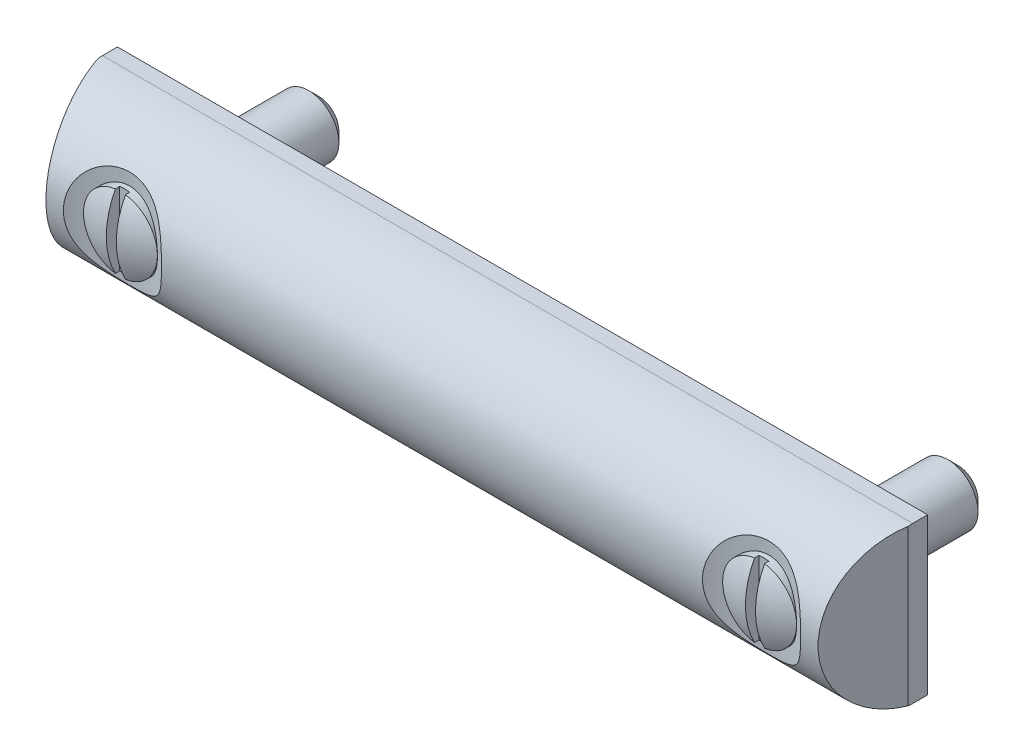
ISO-10303-21;
HEADER;
FILE_DESCRIPTION(('STEP AP214'),'2;1');
FILE_NAME('part.step','',(''),(''),'','','');
FILE_SCHEMA(('AUTOMOTIVE_DESIGN { 1 0 10303 214 1 1 1 1 }'));
ENDSEC;
DATA;
#1=APPLICATION_CONTEXT('core data for automotive mechanical design processes');
#2=APPLICATION_PROTOCOL_DEFINITION('international standard','automotive_design',2000,#1);
#3=PRODUCT_CONTEXT('',#1,'mechanical');
#4=PRODUCT('Part','Part','',(#3));
#5=PRODUCT_RELATED_PRODUCT_CATEGORY('part','',(#4));
#6=PRODUCT_DEFINITION_FORMATION('','',#4);
#7=PRODUCT_DEFINITION_CONTEXT('part definition',#1,'design');
#8=PRODUCT_DEFINITION('design','',#6,#7);
#9=PRODUCT_DEFINITION_SHAPE('','',#8);
#10=(LENGTH_UNIT() NAMED_UNIT(*) SI_UNIT(.MILLI.,.METRE.));
#11=(NAMED_UNIT(*) PLANE_ANGLE_UNIT() SI_UNIT($,.RADIAN.));
#12=(NAMED_UNIT(*) SI_UNIT($,.STERADIAN.) SOLID_ANGLE_UNIT());
#13=UNCERTAINTY_MEASURE_WITH_UNIT(LENGTH_MEASURE(1.E-05),#10,'distance_accuracy_value','');
#14=(GEOMETRIC_REPRESENTATION_CONTEXT(3) GLOBAL_UNCERTAINTY_ASSIGNED_CONTEXT((#13)) GLOBAL_UNIT_ASSIGNED_CONTEXT((#10,
#11,#12)) REPRESENTATION_CONTEXT('',''));
#15=CARTESIAN_POINT('',(0.,0.,0.));
#16=DIRECTION('',(0.,0.,1.));
#17=DIRECTION('',(1.,0.,0.));
#18=AXIS2_PLACEMENT_3D('',#15,#16,#17);
#19=CARTESIAN_POINT('',(127.,0.,2.75255128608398));
#20=DIRECTION('',(0.,-1.,0.));
#21=DIRECTION('',(0.,0.,-1.));
#22=AXIS2_PLACEMENT_3D('',#19,#20,#21);
#23=SPHERICAL_SURFACE('',#22,15.5);
#24=CARTESIAN_POINT('',(127.,0.,16.401552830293));
#25=DIRECTION('',(0.,0.,1.));
#26=DIRECTION('',(0.,-1.,0.));
#27=AXIS2_PLACEMENT_3D('',#24,#25,#26);
#28=CIRCLE('',#27,7.34539017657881);
#29=CARTESIAN_POINT('',(119.654609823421,0.,16.4015528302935));
#30=VERTEX_POINT('',#29);
#31=CARTESIAN_POINT('',(126.,-7.27700191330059,16.4015528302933));
#32=VERTEX_POINT('',#31);
#33=EDGE_CURVE('E211',#30,#32,#28,.T.);
#34=ORIENTED_EDGE('',*,*,#33,.T.);
#35=CARTESIAN_POINT('',(126.,0.,2.75255128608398));
#36=DIRECTION('',(-1.,0.,0.));
#37=DIRECTION('',(0.,0.,1.));
#38=AXIS2_PLACEMENT_3D('',#35,#36,#37);
#39=CIRCLE('',#38,15.467708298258);
#40=CARTESIAN_POINT('',(126.,7.27700191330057,16.401552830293));
#41=VERTEX_POINT('',#40);
#42=EDGE_CURVE('E147',#32,#41,#39,.T.);
#43=ORIENTED_EDGE('',*,*,#42,.T.);
#44=EDGE_CURVE('E210',#41,#30,#28,.T.);
#45=ORIENTED_EDGE('',*,*,#44,.T.);
#46=EDGE_LOOP('',(#34,#43,#45));
#47=FACE_BOUND('',#46,.T.);
#48=ADVANCED_FACE('F14',(#47),#23,.T.);
#49=CARTESIAN_POINT('',(0.,0.,2.75255128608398));
#50=DIRECTION('',(0.,-1.,0.));
#51=DIRECTION('',(0.,0.,-1.));
#52=AXIS2_PLACEMENT_3D('',#49,#50,#51);
#53=SPHERICAL_SURFACE('',#52,15.5);
#54=CARTESIAN_POINT('',(0.,0.,16.4015528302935));
#55=DIRECTION('',(0.,0.,1.));
#56=DIRECTION('',(0.,-1.,0.));
#57=AXIS2_PLACEMENT_3D('',#54,#55,#56);
#58=CIRCLE('',#57,7.34539017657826);
#59=CARTESIAN_POINT('',(-7.34539017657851,0.,16.4015528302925));
#60=VERTEX_POINT('',#59);
#61=CARTESIAN_POINT('',(-1.,-7.27700191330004,16.401552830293));
#62=VERTEX_POINT('',#61);
#63=EDGE_CURVE('E197',#60,#62,#58,.T.);
#64=ORIENTED_EDGE('',*,*,#63,.T.);
#65=CARTESIAN_POINT('',(-1.,0.,2.75255128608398));
#66=DIRECTION('',(-1.,0.,0.));
#67=DIRECTION('',(0.,0.,1.));
#68=AXIS2_PLACEMENT_3D('',#65,#66,#67);
#69=CIRCLE('',#68,15.467708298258);
#70=CARTESIAN_POINT('',(-1.,7.27700191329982,16.4015528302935));
#71=VERTEX_POINT('',#70);
#72=EDGE_CURVE('E165',#62,#71,#69,.T.);
#73=ORIENTED_EDGE('',*,*,#72,.T.);
#74=EDGE_CURVE('E196',#71,#60,#58,.T.);
#75=ORIENTED_EDGE('',*,*,#74,.T.);
#76=EDGE_LOOP('',(#64,#73,#75));
#77=FACE_BOUND('',#76,.T.);
#78=ADVANCED_FACE('F299',(#77),#53,.T.);
#79=CARTESIAN_POINT('',(144.5,-15.5,2.));
#80=DIRECTION('',(-0.965925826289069,0.,-0.258819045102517));
#81=DIRECTION('',(0.258819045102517,0.,-0.965925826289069));
#82=AXIS2_PLACEMENT_3D('',#79,#80,#81);
#83=PLANE('',#82);
#84=CARTESIAN_POINT('',(144.36811875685,-4.9960036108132E-13,2.49218749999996));
#85=DIRECTION('',(-0.965925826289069,0.,-0.258819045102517));
#86=DIRECTION('',(0.258819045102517,0.,-0.965925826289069));
#87=AXIS2_PLACEMENT_3D('',#84,#85,#86);
#88=ELLIPSE('',#87,16.0548688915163,15.5078125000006);
#89=CARTESIAN_POINT('',(144.,-15.4468384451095,3.86602540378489));
#90=VERTEX_POINT('',#89);
#91=CARTESIAN_POINT('',(144.,15.4468384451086,3.86602540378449));
#92=VERTEX_POINT('',#91);
#93=EDGE_CURVE('E232',#90,#92,#88,.T.);
#94=ORIENTED_EDGE('',*,*,#93,.F.);
#95=DIRECTION('',(0.,1.,0.));
#96=VECTOR('',#95,1.);
#97=CARTESIAN_POINT('',(144.,-15.5,3.86602540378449));
#98=LINE('',#97,#96);
#99=EDGE_CURVE('E185',#90,#92,#98,.T.);
#100=ORIENTED_EDGE('',*,*,#99,.T.);
#101=EDGE_LOOP('',(#94,#100));
#102=FACE_BOUND('',#101,.T.);
#103=ADVANCED_FACE('F305',(#102),#83,.F.);
#104=CARTESIAN_POINT('',(-17.5,-15.5,2.));
#105=DIRECTION('',(-0.96592582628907,0.,0.258819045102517));
#106=DIRECTION('',(-0.258819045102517,0.,-0.96592582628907));
#107=AXIS2_PLACEMENT_3D('',#104,#105,#106);
#108=PLANE('',#107);
#109=DIRECTION('',(0.,1.,0.));
#110=VECTOR('',#109,1.);
#111=CARTESIAN_POINT('',(-17.,-15.5,3.86602540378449));
#112=LINE('',#111,#110);
#113=CARTESIAN_POINT('',(-17.,-15.4468384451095,3.86602540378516));
#114=VERTEX_POINT('',#113);
#115=CARTESIAN_POINT('',(-17.,15.4468384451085,3.86602540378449));
#116=VERTEX_POINT('',#115);
#117=EDGE_CURVE('E174',#114,#116,#112,.T.);
#118=ORIENTED_EDGE('',*,*,#117,.F.);
#119=CARTESIAN_POINT('',(-17.3681187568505,-4.9960036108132E-13,2.49218749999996));
#120=DIRECTION('',(-0.96592582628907,0.,0.258819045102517));
#121=DIRECTION('',(0.258819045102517,0.,0.96592582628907));
#122=AXIS2_PLACEMENT_3D('',#119,#120,#121);
#123=ELLIPSE('',#122,16.0548688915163,15.5078125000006);
#124=EDGE_CURVE('E221',#114,#116,#123,.T.);
#125=ORIENTED_EDGE('',*,*,#124,.T.);
#126=EDGE_LOOP('',(#118,#125));
#127=FACE_BOUND('',#126,.T.);
#128=ADVANCED_FACE('F394',(#127),#108,.T.);
#129=CARTESIAN_POINT('',(-17.5,-15.5,0.));
#130=DIRECTION('',(0.,0.,1.));
#131=DIRECTION('',(-1.,0.,0.));
#132=AXIS2_PLACEMENT_3D('',#129,#130,#131);
#133=PLANE('',#132);
#134=DIRECTION('',(1.,0.,0.));
#135=VECTOR('',#134,1.);
#136=CARTESIAN_POINT('',(-17.5,-15.5,0.));
#137=LINE('',#136,#135);
#138=CARTESIAN_POINT('',(-17.,-15.5,0.));
#139=VERTEX_POINT('',#138);
#140=CARTESIAN_POINT('',(144.,-15.5,0.));
#141=VERTEX_POINT('',#140);
#142=EDGE_CURVE('E256',#139,#141,#137,.T.);
#143=ORIENTED_EDGE('',*,*,#142,.F.);
#144=DIRECTION('',(0.,-1.,0.));
#145=VECTOR('',#144,1.);
#146=CARTESIAN_POINT('',(-17.,-22.7709328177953,0.));
#147=LINE('',#146,#145);
#148=CARTESIAN_POINT('',(-17.,15.5,0.));
#149=VERTEX_POINT('',#148);
#150=EDGE_CURVE('E170',#149,#139,#147,.T.);
#151=ORIENTED_EDGE('',*,*,#150,.F.);
#152=DIRECTION('',(1.,0.,0.));
#153=VECTOR('',#152,1.);
#154=CARTESIAN_POINT('',(-17.5,15.5,0.));
#155=LINE('',#154,#153);
#156=CARTESIAN_POINT('',(144.,15.5,0.));
#157=VERTEX_POINT('',#156);
#158=EDGE_CURVE('E254',#149,#157,#155,.T.);
#159=ORIENTED_EDGE('',*,*,#158,.T.);
#160=DIRECTION('',(0.,1.,0.));
#161=VECTOR('',#160,1.);
#162=CARTESIAN_POINT('',(144.,-17.6095122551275,0.));
#163=LINE('',#162,#161);
#164=EDGE_CURVE('E179',#141,#157,#163,.T.);
#165=ORIENTED_EDGE('',*,*,#164,.F.);
#166=EDGE_LOOP('',(#143,#151,#159,#165));
#167=FACE_BOUND('',#166,.T.);
#168=CARTESIAN_POINT('',(127.,0.,0.));
#169=DIRECTION('',(0.,0.,1.));
#170=DIRECTION('',(0.,-1.,0.));
#171=AXIS2_PLACEMENT_3D('',#168,#169,#170);
#172=CIRCLE('',#171,6.);
#173=CARTESIAN_POINT('',(127.,-6.,0.));
#174=VERTEX_POINT('',#173);
#175=EDGE_CURVE('E209',#174,#174,#172,.T.);
#176=ORIENTED_EDGE('',*,*,#175,.T.);
#177=EDGE_LOOP('',(#176));
#178=FACE_BOUND('',#177,.T.);
#179=CARTESIAN_POINT('',(0.,0.,0.));
#180=DIRECTION('',(0.,0.,1.));
#181=DIRECTION('',(0.,-1.,0.));
#182=AXIS2_PLACEMENT_3D('',#179,#180,#181);
#183=CIRCLE('',#182,6.);
#184=CARTESIAN_POINT('',(0.,-6.,0.));
#185=VERTEX_POINT('',#184);
#186=EDGE_CURVE('E195',#185,#185,#183,.T.);
#187=ORIENTED_EDGE('',*,*,#186,.T.);
#188=EDGE_LOOP('',(#187));
#189=FACE_BOUND('',#188,.T.);
#190=ADVANCED_FACE('F396',(#167,#178,#189),#133,.F.);
#191=CARTESIAN_POINT('',(127.,-15.5,30.059425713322));
#192=DIRECTION('',(0.,-1.,0.));
#193=DIRECTION('',(0.,0.,-1.));
#194=AXIS2_PLACEMENT_3D('',#191,#192,#193);
#195=PLANE('',#194);
#196=DIRECTION('',(0.,0.,1.));
#197=VECTOR('',#196,1.);
#198=CARTESIAN_POINT('',(-17.,-15.5,30.0594257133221));
#199=LINE('',#198,#197);
#200=CARTESIAN_POINT('',(-17.,-15.5,2.98437500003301));
#201=VERTEX_POINT('',#200);
#202=EDGE_CURVE('E172',#139,#201,#199,.T.);
#203=ORIENTED_EDGE('',*,*,#202,.F.);
#204=ORIENTED_EDGE('',*,*,#142,.T.);
#205=DIRECTION('',(0.,0.,-1.));
#206=VECTOR('',#205,1.);
#207=CARTESIAN_POINT('',(144.,-15.5,30.059425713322));
#208=LINE('',#207,#206);
#209=CARTESIAN_POINT('',(144.,-15.5,2.98437500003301));
#210=VERTEX_POINT('',#209);
#211=EDGE_CURVE('E182',#210,#141,#208,.T.);
#212=ORIENTED_EDGE('',*,*,#211,.F.);
#213=DIRECTION('',(1.,0.,0.));
#214=VECTOR('',#213,1.);
#215=CARTESIAN_POINT('',(-17.5,-15.5,2.98437500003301));
#216=LINE('',#215,#214);
#217=EDGE_CURVE('E225',#210,#201,#216,.F.);
#218=ORIENTED_EDGE('',*,*,#217,.T.);
#219=EDGE_LOOP('',(#203,#204,#212,#218));
#220=FACE_BOUND('',#219,.T.);
#221=ADVANCED_FACE('F386',(#220),#195,.T.);
#222=CARTESIAN_POINT('',(127.,15.5,30.059425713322));
#223=DIRECTION('',(0.,-1.,0.));
#224=DIRECTION('',(0.,0.,-1.));
#225=AXIS2_PLACEMENT_3D('',#222,#223,#224);
#226=PLANE('',#225);
#227=ORIENTED_EDGE('',*,*,#158,.F.);
#228=DIRECTION('',(0.,0.,1.));
#229=VECTOR('',#228,1.);
#230=CARTESIAN_POINT('',(-17.,15.5,30.0594257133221));
#231=LINE('',#230,#229);
#232=CARTESIAN_POINT('',(-17.,15.5,2.98437500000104));
#233=VERTEX_POINT('',#232);
#234=EDGE_CURVE('E176',#149,#233,#231,.T.);
#235=ORIENTED_EDGE('',*,*,#234,.T.);
#236=DIRECTION('',(1.,0.,0.));
#237=VECTOR('',#236,1.);
#238=CARTESIAN_POINT('',(-17.5,15.5,2.98437500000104));
#239=LINE('',#238,#237);
#240=CARTESIAN_POINT('',(144.,15.5,2.98437500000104));
#241=VERTEX_POINT('',#240);
#242=EDGE_CURVE('E258',#241,#233,#239,.F.);
#243=ORIENTED_EDGE('',*,*,#242,.F.);
#244=DIRECTION('',(0.,0.,-1.));
#245=VECTOR('',#244,1.);
#246=CARTESIAN_POINT('',(144.,15.5,30.059425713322));
#247=LINE('',#246,#245);
#248=EDGE_CURVE('E188',#241,#157,#247,.T.);
#249=ORIENTED_EDGE('',*,*,#248,.T.);
#250=EDGE_LOOP('',(#227,#235,#243,#249));
#251=FACE_BOUND('',#250,.T.);
#252=ADVANCED_FACE('F242',(#251),#226,.F.);
#253=CARTESIAN_POINT('',(-17.5,-4.9960036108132E-13,2.49218749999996));
#254=DIRECTION('',(1.,0.,0.));
#255=DIRECTION('',(0.,-1.,0.));
#256=AXIS2_PLACEMENT_3D('',#253,#254,#255);
#257=CYLINDRICAL_SURFACE('',#256,15.5078125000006);
#258=CARTESIAN_POINT('',(-17.,-4.9960036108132E-13,2.49218749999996));
#259=DIRECTION('',(1.,0.,0.));
#260=DIRECTION('',(0.,0.,1.));
#261=AXIS2_PLACEMENT_3D('',#258,#259,#260);
#262=CIRCLE('',#261,15.5078125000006);
#263=EDGE_CURVE('E366',#116,#233,#262,.F.);
#264=ORIENTED_EDGE('',*,*,#263,.F.);
#265=ORIENTED_EDGE('',*,*,#124,.F.);
#266=EDGE_CURVE('E370',#201,#114,#262,.F.);
#267=ORIENTED_EDGE('',*,*,#266,.F.);
#268=ORIENTED_EDGE('',*,*,#217,.F.);
#269=CARTESIAN_POINT('',(144.,-4.9960036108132E-13,2.49218749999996));
#270=DIRECTION('',(-1.,0.,0.));
#271=DIRECTION('',(0.,0.,-1.));
#272=AXIS2_PLACEMENT_3D('',#269,#270,#271);
#273=CIRCLE('',#272,15.5078125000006);
#274=EDGE_CURVE('E343',#90,#210,#273,.F.);
#275=ORIENTED_EDGE('',*,*,#274,.F.);
#276=ORIENTED_EDGE('',*,*,#93,.T.);
#277=EDGE_CURVE('E371',#241,#92,#273,.F.);
#278=ORIENTED_EDGE('',*,*,#277,.F.);
#279=ORIENTED_EDGE('',*,*,#242,.T.);
#280=EDGE_LOOP('',(#264,#265,#267,#268,#275,#276,#278,#279));
#281=FACE_BOUND('',#280,.T.);
#282=CARTESIAN_POINT('',(127.,-9.75000000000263,14.551613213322));
#283=CARTESIAN_POINT('',(127.265735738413,-9.75000015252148,14.5516150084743));
#284=CARTESIAN_POINT('',(127.53152426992,-9.74155487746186,14.5584562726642));
#285=CARTESIAN_POINT('',(128.061424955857,-9.70770683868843,14.5857037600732));
#286=CARTESIAN_POINT('',(128.325536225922,-9.68229577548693,14.606116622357));
#287=CARTESIAN_POINT('',(128.85071862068,-9.6142708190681,14.6601757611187));
#288=CARTESIAN_POINT('',(129.111782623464,-9.57162268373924,14.6938483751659));
#289=CARTESIAN_POINT('',(129.628465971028,-9.46887485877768,14.773754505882));
#290=CARTESIAN_POINT('',(129.884086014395,-9.40877742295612,14.8199864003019));
#291=CARTESIAN_POINT('',(130.388279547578,-9.27077679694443,14.9240987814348));
#292=CARTESIAN_POINT('',(130.636847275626,-9.19285949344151,14.9819884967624));
#293=CARTESIAN_POINT('',(131.124883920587,-9.01896097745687,15.1081346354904));
#294=CARTESIAN_POINT('',(131.364352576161,-8.92297924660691,15.1763913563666));
#295=CARTESIAN_POINT('',(131.832182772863,-8.71283993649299,15.3216442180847));
#296=CARTESIAN_POINT('',(132.0605528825,-8.59869667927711,15.3986334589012));
#297=CARTESIAN_POINT('',(132.504647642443,-8.35214805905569,15.559533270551));
#298=CARTESIAN_POINT('',(132.720372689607,-8.21974326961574,15.6434436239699));
#299=CARTESIAN_POINT('',(133.133837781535,-7.93941225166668,15.8145162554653));
#300=CARTESIAN_POINT('',(133.331831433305,-7.79180785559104,15.9015929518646));
#301=CARTESIAN_POINT('',(133.712782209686,-7.47963029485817,16.0781922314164));
#302=CARTESIAN_POINT('',(133.895739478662,-7.31505729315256,16.1677147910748));
#303=CARTESIAN_POINT('',(134.245550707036,-6.96968700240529,16.346917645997));
#304=CARTESIAN_POINT('',(134.412404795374,-6.78888984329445,16.4365979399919));
#305=CARTESIAN_POINT('',(134.729227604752,-6.41209853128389,16.6138223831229));
#306=CARTESIAN_POINT('',(134.879196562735,-6.21610459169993,16.7013665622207));
#307=CARTESIAN_POINT('',(135.157663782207,-5.81608535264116,16.8696388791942));
#308=CARTESIAN_POINT('',(135.28665805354,-5.61245700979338,16.9504909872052));
#309=CARTESIAN_POINT('',(135.528056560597,-5.19343881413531,17.1062353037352));
#310=CARTESIAN_POINT('',(135.640461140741,-4.978049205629,17.1811276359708));
#311=CARTESIAN_POINT('',(135.848690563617,-4.53695609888,17.3233027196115));
#312=CARTESIAN_POINT('',(135.944513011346,-4.31125111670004,17.3905843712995));
#313=CARTESIAN_POINT('',(136.119701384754,-3.85111009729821,17.5161042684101));
#314=CARTESIAN_POINT('',(136.199066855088,-3.61667381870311,17.574342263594));
#315=CARTESIAN_POINT('',(136.343256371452,-3.13502300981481,17.681861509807));
#316=CARTESIAN_POINT('',(136.407691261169,-2.88763732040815,17.7308978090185));
#317=CARTESIAN_POINT('',(136.519829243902,-2.38710454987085,17.8172808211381));
#318=CARTESIAN_POINT('',(136.567532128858,-2.13395739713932,17.8546273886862));
#319=CARTESIAN_POINT('',(136.64647128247,-1.62354507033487,17.9169230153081));
#320=CARTESIAN_POINT('',(136.677703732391,-1.36627895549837,17.9418691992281));
#321=CARTESIAN_POINT('',(136.723877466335,-0.849368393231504,17.9788905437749));
#322=CARTESIAN_POINT('',(136.738818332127,-0.589723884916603,17.990965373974));
#323=CARTESIAN_POINT('',(136.752792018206,-0.0588748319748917,18.0022540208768));
#324=CARTESIAN_POINT('',(136.751135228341,0.212360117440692,18.0009103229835));
#325=CARTESIAN_POINT('',(136.730236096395,0.753715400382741,17.9840403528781));
#326=CARTESIAN_POINT('',(136.710993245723,1.02383570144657,17.9685136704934));
#327=CARTESIAN_POINT('',(136.65478259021,1.56108793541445,17.9235814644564));
#328=CARTESIAN_POINT('',(136.617813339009,1.82821962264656,17.894174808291));
#329=CARTESIAN_POINT('',(136.525909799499,2.35755747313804,17.8220771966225));
#330=CARTESIAN_POINT('',(136.470975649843,2.61976367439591,17.7793863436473));
#331=CARTESIAN_POINT('',(136.342427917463,3.13897895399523,17.6813053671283));
#332=CARTESIAN_POINT('',(136.268697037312,3.39594403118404,17.6258357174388));
#333=CARTESIAN_POINT('',(136.102415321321,3.90095280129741,17.5035934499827));
#334=CARTESIAN_POINT('',(136.009864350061,4.14899643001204,17.436820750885));
#335=CARTESIAN_POINT('',(135.80573224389,4.63411492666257,17.2935783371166));
#336=CARTESIAN_POINT('',(135.694157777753,4.87119360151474,17.2171120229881));
#337=CARTESIAN_POINT('',(135.451864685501,5.33257844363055,17.056374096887));
#338=CARTESIAN_POINT('',(135.321146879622,5.5568851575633,16.9721028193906));
#339=CARTESIAN_POINT('',(135.045910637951,5.98292773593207,16.8011899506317));
#340=CARTESIAN_POINT('',(134.902083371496,6.18519205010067,16.71475201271));
#341=CARTESIAN_POINT('',(134.597199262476,6.57487783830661,16.5388573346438));
#342=CARTESIAN_POINT('',(134.436142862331,6.76229969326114,16.449400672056));
#343=CARTESIAN_POINT('',(134.097507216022,7.12112932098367,16.2697790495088));
#344=CARTESIAN_POINT('',(133.919930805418,7.29253983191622,16.1796142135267));
#345=CARTESIAN_POINT('',(133.549202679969,7.61852106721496,16.0008865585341));
#346=CARTESIAN_POINT('',(133.356051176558,7.77309202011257,15.9123237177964));
#347=CARTESIAN_POINT('',(132.961823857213,8.06016124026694,15.741830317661));
#348=CARTESIAN_POINT('',(132.761198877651,8.1932072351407,15.6597782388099));
#349=CARTESIAN_POINT('',(132.347837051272,8.44272803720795,15.5012018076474));
#350=CARTESIAN_POINT('',(132.135100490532,8.559203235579,15.4246773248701));
#351=CARTESIAN_POINT('',(131.698935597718,8.77555101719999,15.2788595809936));
#352=CARTESIAN_POINT('',(131.475505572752,8.87542096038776,15.2095674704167));
#353=CARTESIAN_POINT('',(131.019526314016,9.05864880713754,15.0797109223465));
#354=CARTESIAN_POINT('',(130.786976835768,9.14200626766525,15.0191467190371));
#355=CARTESIAN_POINT('',(130.30944539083,9.29398048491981,14.9068278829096));
#356=CARTESIAN_POINT('',(130.064305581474,9.36225551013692,14.8552821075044));
#357=CARTESIAN_POINT('',(129.567887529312,9.48209274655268,14.7636120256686));
#358=CARTESIAN_POINT('',(129.316609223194,9.53365478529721,14.723487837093));
#359=CARTESIAN_POINT('',(128.809549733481,9.62033966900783,14.6554252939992));
#360=CARTESIAN_POINT('',(128.553767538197,9.65545877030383,14.6274897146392));
#361=CARTESIAN_POINT('',(128.039429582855,9.70945001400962,14.5843346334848));
#362=CARTESIAN_POINT('',(127.780873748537,9.7283217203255,14.5691154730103));
#363=CARTESIAN_POINT('',(127.251650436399,9.75039813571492,14.5513003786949));
#364=CARTESIAN_POINT('',(126.980934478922,9.75290422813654,14.5492673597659));
#365=CARTESIAN_POINT('',(126.440165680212,9.740411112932,14.5593620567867));
#366=CARTESIAN_POINT('',(126.170112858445,9.72541139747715,14.5714901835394));
#367=CARTESIAN_POINT('',(125.632524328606,9.67779618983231,14.6096724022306));
#368=CARTESIAN_POINT('',(125.36498888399,9.64517887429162,14.6357279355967));
#369=CARTESIAN_POINT('',(124.834362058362,9.56211093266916,14.7012447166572));
#370=CARTESIAN_POINT('',(124.571270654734,9.51166039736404,14.7407058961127));
#371=CARTESIAN_POINT('',(124.049020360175,9.39207898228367,14.8326428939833));
#372=CARTESIAN_POINT('',(123.789921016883,9.32277829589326,14.8852366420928));
#373=CARTESIAN_POINT('',(123.280183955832,9.16539011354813,15.002082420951));
#374=CARTESIAN_POINT('',(123.029546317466,9.0773024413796,15.0663345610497));
#375=CARTESIAN_POINT('',(122.538792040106,8.88210195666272,15.204969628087));
#376=CARTESIAN_POINT('',(122.298671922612,8.77499549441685,15.2793491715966));
#377=CARTESIAN_POINT('',(121.830788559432,8.54160120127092,15.4364166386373));
#378=CARTESIAN_POINT('',(121.603024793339,8.41531417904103,15.5191042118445));
#379=CARTESIAN_POINT('',(121.169445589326,8.14843903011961,15.6876106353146));
#380=CARTESIAN_POINT('',(120.963139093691,8.00851347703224,15.7732157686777));
#381=CARTESIAN_POINT('',(120.565135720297,7.71121081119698,15.9480113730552));
#382=CARTESIAN_POINT('',(120.373438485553,7.553834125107,16.0372017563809));
#383=CARTESIAN_POINT('',(120.005903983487,7.22227340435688,16.2168567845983));
#384=CARTESIAN_POINT('',(119.830063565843,7.04809272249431,16.3073211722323));
#385=CARTESIAN_POINT('',(119.495139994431,6.68380770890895,16.4871941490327));
#386=CARTESIAN_POINT('',(119.336056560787,6.49370364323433,16.5766027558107));
#387=CARTESIAN_POINT('',(119.040434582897,6.10552252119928,16.7490592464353));
#388=CARTESIAN_POINT('',(118.903311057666,5.90794052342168,16.832220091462));
#389=CARTESIAN_POINT('',(118.645611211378,5.50031563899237,16.9934566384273));
#390=CARTESIAN_POINT('',(118.525034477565,5.29027306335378,17.0715324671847));
#391=CARTESIAN_POINT('',(118.300507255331,4.85912275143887,17.2208407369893));
#392=CARTESIAN_POINT('',(118.196559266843,4.63801335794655,17.2920721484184));
#393=CARTESIAN_POINT('',(118.005231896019,4.18628553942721,17.4261344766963));
#394=CARTESIAN_POINT('',(117.917852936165,3.95566687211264,17.4889651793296));
#395=CARTESIAN_POINT('',(117.758071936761,3.48235984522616,17.6059523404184));
#396=CARTESIAN_POINT('',(117.685961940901,3.23953019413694,17.6599358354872));
#397=CARTESIAN_POINT('',(117.558438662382,2.7473584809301,17.7567601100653));
#398=CARTESIAN_POINT('',(117.503025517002,2.49801636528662,17.7996007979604));
#399=CARTESIAN_POINT('',(117.408616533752,1.99444700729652,17.8733187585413));
#400=CARTESIAN_POINT('',(117.369624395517,1.74021867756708,17.9041933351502));
#401=CARTESIAN_POINT('',(117.30785063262,1.22859685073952,17.9533921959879));
#402=CARTESIAN_POINT('',(117.285069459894,0.971203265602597,17.9717161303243));
#403=CARTESIAN_POINT('',(117.254941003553,0.44381879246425,17.9959903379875));
#404=CARTESIAN_POINT('',(117.248297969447,0.17376130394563,18.0013758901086));
#405=CARTESIAN_POINT('',(117.252439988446,-0.36613742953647,17.9980274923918));
#406=CARTESIAN_POINT('',(117.263225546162,-0.635978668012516,17.9892931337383));
#407=CARTESIAN_POINT('',(117.302305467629,-1.1736096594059,17.9578721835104));
#408=CARTESIAN_POINT('',(117.330601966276,-1.4413991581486,17.9351838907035));
#409=CARTESIAN_POINT('',(117.404897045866,-1.97301126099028,17.8763024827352));
#410=CARTESIAN_POINT('',(117.450895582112,-2.23683387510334,17.8401094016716));
#411=CARTESIAN_POINT('',(117.561542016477,-2.76179855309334,17.754438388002));
#412=CARTESIAN_POINT('',(117.626410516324,-3.02286868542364,17.7048038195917));
#413=CARTESIAN_POINT('',(117.774890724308,-3.53701280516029,17.593544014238));
#414=CARTESIAN_POINT('',(117.858502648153,-3.79008670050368,17.5319186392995));
#415=CARTESIAN_POINT('',(118.044733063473,-4.2861758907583,17.398123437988));
#416=CARTESIAN_POINT('',(118.147345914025,-4.52919414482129,17.3259567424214));
#417=CARTESIAN_POINT('',(118.37177104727,-5.00330304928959,17.1728298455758));
#418=CARTESIAN_POINT('',(118.493582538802,-5.23439419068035,17.0918700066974));
#419=CARTESIAN_POINT('',(118.752000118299,-5.67533591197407,16.9260519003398));
#420=CARTESIAN_POINT('',(118.887977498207,-5.88563779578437,16.8414136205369));
#421=CARTESIAN_POINT('',(119.177592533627,-6.29188147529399,16.6679858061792));
#422=CARTESIAN_POINT('',(119.33122978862,-6.48782359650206,16.5791963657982));
#423=CARTESIAN_POINT('',(119.655566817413,-6.86399968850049,16.3997818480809));
#424=CARTESIAN_POINT('',(119.826260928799,-7.04423883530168,16.3091573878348));
#425=CARTESIAN_POINT('',(120.183907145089,-7.3880628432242,16.1284079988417));
#426=CARTESIAN_POINT('',(120.370858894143,-7.55164806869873,16.038283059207));
#427=CARTESIAN_POINT('',(120.752795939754,-7.855804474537,15.8641052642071));
#428=CARTESIAN_POINT('',(120.947241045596,-7.9969966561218,15.7799507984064));
#429=CARTESIAN_POINT('',(121.348934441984,-8.26287337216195,15.6162704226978));
#430=CARTESIAN_POINT('',(121.556182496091,-8.3875582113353,15.5367444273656));
#431=CARTESIAN_POINT('',(121.982223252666,-8.62034957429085,15.384092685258));
#432=CARTESIAN_POINT('',(122.201023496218,-8.72844508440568,15.3109712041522));
#433=CARTESIAN_POINT('',(122.648523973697,-8.92799815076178,15.1727960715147));
#434=CARTESIAN_POINT('',(122.877224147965,-9.01945580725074,15.1077423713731));
#435=CARTESIAN_POINT('',(123.346506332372,-9.18717843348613,14.9861421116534));
#436=CARTESIAN_POINT('',(123.587216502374,-9.26318989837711,14.9297407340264));
#437=CARTESIAN_POINT('',(124.075565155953,-9.39850407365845,14.8278087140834));
#438=CARTESIAN_POINT('',(124.323204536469,-9.45780460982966,14.7822794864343));
#439=CARTESIAN_POINT('',(124.82324930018,-9.55986500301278,14.703059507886));
#440=CARTESIAN_POINT('',(125.075645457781,-9.60265399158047,14.669347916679));
#441=CARTESIAN_POINT('',(125.583887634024,-9.67206321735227,14.6142919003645));
#442=CARTESIAN_POINT('',(125.83973203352,-9.6986907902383,14.5929418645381));
#443=CARTESIAN_POINT('',(126.246645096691,-9.72822689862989,14.5691913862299));
#444=CARTESIAN_POINT('',(126.397118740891,-9.73639311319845,14.562603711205));
#445=CARTESIAN_POINT('',(126.698389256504,-9.74727960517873,14.5538141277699));
#446=CARTESIAN_POINT('',(126.849186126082,-9.74999991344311,14.5516121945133));
#447=CARTESIAN_POINT('',(127.,-9.75000000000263,14.551613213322));
#448=B_SPLINE_CURVE_WITH_KNOTS('',3,(#282,#283,#284,#285,#286,#287,#288,#289,#290,#291,#292,
#293,#294,#295,#296,#297,#298,#299,#300,#301,#302,#303,#304,#305,#306,#307,#308,#309,#310,#311,
#312,#313,#314,#315,#316,#317,#318,#319,#320,#321,#322,#323,#324,#325,#326,#327,#328,#329,#330,
#331,#332,#333,#334,#335,#336,#337,#338,#339,#340,#341,#342,#343,#344,#345,#346,#347,#348,#349,
#350,#351,#352,#353,#354,#355,#356,#357,#358,#359,#360,#361,#362,#363,#364,#365,#366,#367,#368,
#369,#370,#371,#372,#373,#374,#375,#376,#377,#378,#379,#380,#381,#382,#383,#384,#385,#386,#387,
#388,#389,#390,#391,#392,#393,#394,#395,#396,#397,#398,#399,#400,#401,#402,#403,#404,#405,#406,
#407,#408,#409,#410,#411,#412,#413,#414,#415,#416,#417,#418,#419,#420,#421,#422,#423,#424,#425,
#426,#427,#428,#429,#430,#431,#432,#433,#434,#435,#436,#437,#438,#439,#440,#441,#442,#443,#444,
#445,#446,#447),.UNSPECIFIED.,.T.,.F.,(4,2,2,2,2,2,2,2,2,2,2,2,2,2,2,2,2,2,2,2,2,2,2,2,2,2,2,2,
2,2,2,2,2,2,2,2,2,2,2,2,2,2,2,2,2,2,2,2,2,2,2,2,2,2,2,2,2,2,2,2,2,2,2,2,2,2,2,2,2,2,2,2,2,2,2,2,
2,2,2,2,2,2,4),(0.,0.79707632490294,1.59454285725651,2.39360143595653,3.1925568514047,
3.99214724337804,4.79176058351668,5.59074645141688,6.38970723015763,7.1743045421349,
7.95889432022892,8.7434778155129,9.52805029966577,10.2899018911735,11.0517376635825,
11.8136833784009,12.5756501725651,13.3556733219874,14.1357061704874,14.9159197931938,
15.6961534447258,16.5089348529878,17.3217397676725,18.1346110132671,18.9474759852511,
19.7655432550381,20.5836164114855,21.4014033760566,22.2191553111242,23.0065949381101,
23.794014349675,24.5812988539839,25.3685726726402,26.1306742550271,26.8927578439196,
27.6549624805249,28.4171875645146,29.1952276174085,29.9732756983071,30.7515008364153,
31.529746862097,32.3410089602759,33.1522945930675,33.9636642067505,34.7750296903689,
35.593961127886,36.4129002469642,37.2315664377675,38.0501981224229,38.8399187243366,
39.6296200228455,40.4191640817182,41.208694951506,41.9712227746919,42.7337315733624,
43.4963548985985,44.2589976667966,45.0351213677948,45.811251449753,46.5875562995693,
47.3638827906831,48.1735230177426,48.9831866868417,49.7929490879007,50.6027094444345,
51.4223454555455,52.241990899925,53.061393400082,53.8807621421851,54.6728111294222,
55.464842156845,56.2566111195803,57.048362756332,57.8112922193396,58.5742075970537,
59.3376273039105,60.1010424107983,60.8761228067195,61.6513039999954,62.425111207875,
63.1985669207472,63.6509368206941,64.103304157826),.UNSPECIFIED.);
#449=CARTESIAN_POINT('',(127.,-9.75000000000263,14.551613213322));
#450=VERTEX_POINT('',#449);
#451=EDGE_CURVE('E224',#450,#450,#448,.T.);
#452=ORIENTED_EDGE('',*,*,#451,.F.);
#453=EDGE_LOOP('',(#452));
#454=FACE_BOUND('',#453,.T.);
#455=CARTESIAN_POINT('',(-4.9960036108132E-13,-9.7500000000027,14.551613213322));
#456=CARTESIAN_POINT('',(0.265735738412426,-9.75000015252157,14.5516150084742));
#457=CARTESIAN_POINT('',(0.531524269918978,-9.74155487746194,14.5584562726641));
#458=CARTESIAN_POINT('',(1.06142495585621,-9.70770683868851,14.5857037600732));
#459=CARTESIAN_POINT('',(1.3255362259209,-9.68229577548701,14.6061166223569));
#460=CARTESIAN_POINT('',(1.85071862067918,-9.61427081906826,14.6601757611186));
#461=CARTESIAN_POINT('',(2.11178262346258,-9.57162268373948,14.6938483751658));
#462=CARTESIAN_POINT('',(2.62846597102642,-9.46887485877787,14.7737545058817));
#463=CARTESIAN_POINT('',(2.88408601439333,-9.40877742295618,14.8199864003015));
#464=CARTESIAN_POINT('',(3.38827954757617,-9.27077679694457,14.9240987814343));
#465=CARTESIAN_POINT('',(3.63684727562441,-9.19285949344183,14.981988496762));
#466=CARTESIAN_POINT('',(4.12488392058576,-9.01896097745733,15.1081346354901));
#467=CARTESIAN_POINT('',(4.36435257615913,-8.92297924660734,15.1763913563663));
#468=CARTESIAN_POINT('',(4.83218277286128,-8.71283993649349,15.3216442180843));
#469=CARTESIAN_POINT('',(5.060552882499,-8.59869667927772,15.3986334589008));
#470=CARTESIAN_POINT('',(5.50464764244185,-8.35214805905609,15.5595332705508));
#471=CARTESIAN_POINT('',(5.72037268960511,-8.21974326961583,15.6434436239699));
#472=CARTESIAN_POINT('',(6.13383778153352,-7.93941225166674,15.8145162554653));
#473=CARTESIAN_POINT('',(6.33183143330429,-7.79180785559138,15.9015929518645));
#474=CARTESIAN_POINT('',(6.71278220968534,-7.47963029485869,16.0781922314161));
#475=CARTESIAN_POINT('',(6.89573947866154,-7.31505729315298,16.1677147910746));
#476=CARTESIAN_POINT('',(7.24555070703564,-6.96968700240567,16.3469176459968));
#477=CARTESIAN_POINT('',(7.41240479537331,-6.7888898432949,16.4365979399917));
#478=CARTESIAN_POINT('',(7.72922760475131,-6.41209853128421,16.6138223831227));
#479=CARTESIAN_POINT('',(7.87919656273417,-6.21610459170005,16.7013665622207));
#480=CARTESIAN_POINT('',(8.15766378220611,-5.81608535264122,16.8696388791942));
#481=CARTESIAN_POINT('',(8.28665805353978,-5.61245700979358,16.9504909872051));
#482=CARTESIAN_POINT('',(8.52805656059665,-5.1934388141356,17.106235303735));
#483=CARTESIAN_POINT('',(8.64046114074,-4.97804920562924,17.1811276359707));
#484=CARTESIAN_POINT('',(8.84869056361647,-4.53695609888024,17.3233027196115));
#485=CARTESIAN_POINT('',(8.94451301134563,-4.31125111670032,17.3905843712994));
#486=CARTESIAN_POINT('',(9.11970138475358,-3.85111009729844,17.51610426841));
#487=CARTESIAN_POINT('',(9.19906685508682,-3.61667381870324,17.574342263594));
#488=CARTESIAN_POINT('',(9.34325637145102,-3.1350230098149,17.681861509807));
#489=CARTESIAN_POINT('',(9.40769126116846,-2.88763732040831,17.7308978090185));
#490=CARTESIAN_POINT('',(9.51982924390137,-2.38710454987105,17.817280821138));
#491=CARTESIAN_POINT('',(9.56753212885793,-2.1339573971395,17.8546273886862));
#492=CARTESIAN_POINT('',(9.64647128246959,-1.62354507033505,17.9169230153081));
#493=CARTESIAN_POINT('',(9.67770373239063,-1.36627895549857,17.941869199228));
#494=CARTESIAN_POINT('',(9.723877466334,-0.849368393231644,17.9788905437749));
#495=CARTESIAN_POINT('',(9.73881833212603,-0.589723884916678,17.990965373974));
#496=CARTESIAN_POINT('',(9.75279201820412,-0.0588748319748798,18.0022540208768));
#497=CARTESIAN_POINT('',(9.75113522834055,0.212360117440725,18.0009103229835));
#498=CARTESIAN_POINT('',(9.73023609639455,0.753715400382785,17.9840403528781));
#499=CARTESIAN_POINT('',(9.71099324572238,1.02383570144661,17.9685136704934));
#500=CARTESIAN_POINT('',(9.6547825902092,1.56108793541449,17.9235814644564));
#501=CARTESIAN_POINT('',(9.61781333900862,1.8282196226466,17.894174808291));
#502=CARTESIAN_POINT('',(9.52590979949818,2.35755747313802,17.8220771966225));
#503=CARTESIAN_POINT('',(9.47097564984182,2.61976367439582,17.7793863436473));
#504=CARTESIAN_POINT('',(9.34242791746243,3.13897895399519,17.6813053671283));
#505=CARTESIAN_POINT('',(9.2686970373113,3.39594403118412,17.6258357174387));
#506=CARTESIAN_POINT('',(9.10241532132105,3.90095280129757,17.5035934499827));
#507=CARTESIAN_POINT('',(9.00986435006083,4.14899643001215,17.436820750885));
#508=CARTESIAN_POINT('',(8.80573224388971,4.63411492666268,17.2935783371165));
#509=CARTESIAN_POINT('',(8.69415777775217,4.87119360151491,17.2171120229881));
#510=CARTESIAN_POINT('',(8.45186468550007,5.33257844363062,17.0563740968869));
#511=CARTESIAN_POINT('',(8.32114687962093,5.55688515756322,16.9721028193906));
#512=CARTESIAN_POINT('',(8.0459106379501,5.98292773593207,16.8011899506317));
#513=CARTESIAN_POINT('',(7.90208337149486,6.1851920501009,16.7147520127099));
#514=CARTESIAN_POINT('',(7.59719926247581,6.574877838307,16.5388573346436));
#515=CARTESIAN_POINT('',(7.43614286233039,6.76229969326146,16.4494006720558));
#516=CARTESIAN_POINT('',(7.0975072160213,7.12112932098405,16.2697790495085));
#517=CARTESIAN_POINT('',(6.91993080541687,7.29253983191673,16.1796142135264));
#518=CARTESIAN_POINT('',(6.54920267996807,7.61852106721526,16.000886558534));
#519=CARTESIAN_POINT('',(6.35605117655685,7.77309202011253,15.9123237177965));
#520=CARTESIAN_POINT('',(5.96182385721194,8.06016124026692,15.741830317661));
#521=CARTESIAN_POINT('',(5.76119887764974,8.19320723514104,15.6597782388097));
#522=CARTESIAN_POINT('',(5.34783705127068,8.44272803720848,15.5012018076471));
#523=CARTESIAN_POINT('',(5.13510049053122,8.5592032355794,15.4246773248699));
#524=CARTESIAN_POINT('',(4.69893559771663,8.77555101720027,15.2788595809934));
#525=CARTESIAN_POINT('',(4.47550557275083,8.87542096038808,15.2095674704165));
#526=CARTESIAN_POINT('',(4.0195263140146,9.05864880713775,15.0797109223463));
#527=CARTESIAN_POINT('',(3.78697683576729,9.14200626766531,15.0191467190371));
#528=CARTESIAN_POINT('',(3.30944539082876,9.29398048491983,14.9068278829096));
#529=CARTESIAN_POINT('',(3.06430558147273,9.36225551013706,14.8552821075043));
#530=CARTESIAN_POINT('',(2.56788752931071,9.48209274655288,14.7636120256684));
#531=CARTESIAN_POINT('',(2.31660922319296,9.53365478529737,14.7234878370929));
#532=CARTESIAN_POINT('',(1.8095497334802,9.62033966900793,14.6554252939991));
#533=CARTESIAN_POINT('',(1.55376753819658,9.65545877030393,14.6274897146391));
#534=CARTESIAN_POINT('',(1.03942958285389,9.70945001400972,14.5843346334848));
#535=CARTESIAN_POINT('',(0.780873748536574,9.72832172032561,14.5691154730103));
#536=CARTESIAN_POINT('',(0.251650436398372,9.75039813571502,14.5513003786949));
#537=CARTESIAN_POINT('',(-0.0190655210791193,9.75290422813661,14.5492673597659));
#538=CARTESIAN_POINT('',(-0.559834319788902,9.74041111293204,14.5593620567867));
#539=CARTESIAN_POINT('',(-0.829887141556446,9.72541139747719,14.5714901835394));
#540=CARTESIAN_POINT('',(-1.36747567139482,9.67779618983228,14.6096724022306));
#541=CARTESIAN_POINT('',(-1.63501111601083,9.6451788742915,14.6357279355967));
#542=CARTESIAN_POINT('',(-2.16563794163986,9.56211093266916,14.7012447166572));
#543=CARTESIAN_POINT('',(-2.42872934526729,9.51166039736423,14.7407058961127));
#544=CARTESIAN_POINT('',(-2.95097963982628,9.39207898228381,14.8326428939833));
#545=CARTESIAN_POINT('',(-3.21007898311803,9.32277829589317,14.8852366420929));
#546=CARTESIAN_POINT('',(-3.71981604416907,9.16539011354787,15.0020824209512));
#547=CARTESIAN_POINT('',(-3.97045368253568,9.0773024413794,15.0663345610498));
#548=CARTESIAN_POINT('',(-4.46120795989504,8.88210195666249,15.2049696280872));
#549=CARTESIAN_POINT('',(-4.7013280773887,8.77499549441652,15.2793491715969));
#550=CARTESIAN_POINT('',(-5.16921144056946,8.5416012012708,15.4364166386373));
#551=CARTESIAN_POINT('',(-5.39697520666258,8.41531417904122,15.519104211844));
#552=CARTESIAN_POINT('',(-5.83055441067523,8.14843903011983,15.6876106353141));
#553=CARTESIAN_POINT('',(-6.03686090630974,8.00851347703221,15.7732157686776));
#554=CARTESIAN_POINT('',(-6.43486427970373,7.71121081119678,15.9480113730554));
#555=CARTESIAN_POINT('',(-6.62656151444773,7.55383412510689,16.037201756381));
#556=CARTESIAN_POINT('',(-6.99409601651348,7.22227340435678,16.2168567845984));
#557=CARTESIAN_POINT('',(-7.16993643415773,7.04809272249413,16.3073211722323));
#558=CARTESIAN_POINT('',(-7.50486000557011,6.68380770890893,16.4871941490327));
#559=CARTESIAN_POINT('',(-7.66394343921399,6.49370364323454,16.5766027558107));
#560=CARTESIAN_POINT('',(-7.95956541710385,6.10552252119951,16.7490592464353));
#561=CARTESIAN_POINT('',(-8.0966889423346,5.90794052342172,16.832220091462));
#562=CARTESIAN_POINT('',(-8.35438878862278,5.50031563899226,16.9934566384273));
#563=CARTESIAN_POINT('',(-8.47496552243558,5.29027306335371,17.0715324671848));
#564=CARTESIAN_POINT('',(-8.69949274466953,4.85912275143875,17.2208407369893));
#565=CARTESIAN_POINT('',(-8.80344073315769,4.63801335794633,17.2920721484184));
#566=CARTESIAN_POINT('',(-8.99476810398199,4.18628553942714,17.4261344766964));
#567=CARTESIAN_POINT('',(-9.08214706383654,3.95566687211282,17.4889651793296));
#568=CARTESIAN_POINT('',(-9.24192806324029,3.48235984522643,17.6059523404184));
#569=CARTESIAN_POINT('',(-9.31403805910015,3.23953019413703,17.6599358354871));
#570=CARTESIAN_POINT('',(-9.44156133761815,2.74735848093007,17.7567601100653));
#571=CARTESIAN_POINT('',(-9.49697448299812,2.49801636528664,17.7996007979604));
#572=CARTESIAN_POINT('',(-9.59138346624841,1.99444700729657,17.8733187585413));
#573=CARTESIAN_POINT('',(-9.63037560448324,1.7402186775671,17.9041933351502));
#574=CARTESIAN_POINT('',(-9.6921493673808,1.22859685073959,17.9533921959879));
#575=CARTESIAN_POINT('',(-9.71493054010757,0.971203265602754,17.9717161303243));
#576=CARTESIAN_POINT('',(-9.74505899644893,0.443818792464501,17.9959903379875));
#577=CARTESIAN_POINT('',(-9.75170203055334,0.173761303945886,18.0013758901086));
#578=CARTESIAN_POINT('',(-9.74756001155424,-0.366137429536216,17.9980274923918));
#579=CARTESIAN_POINT('',(-9.73677445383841,-0.635978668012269,17.9892931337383));
#580=CARTESIAN_POINT('',(-9.69769453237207,-1.17360965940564,17.9578721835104));
#581=CARTESIAN_POINT('',(-9.66939803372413,-1.44139915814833,17.9351838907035));
#582=CARTESIAN_POINT('',(-9.5951029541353,-1.97301126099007,17.8763024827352));
#583=CARTESIAN_POINT('',(-9.54910441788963,-2.23683387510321,17.8401094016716));
#584=CARTESIAN_POINT('',(-9.43845798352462,-2.76179855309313,17.754438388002));
#585=CARTESIAN_POINT('',(-9.37358948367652,-3.02286868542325,17.7048038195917));
#586=CARTESIAN_POINT('',(-9.22510927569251,-3.53701280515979,17.5935440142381));
#587=CARTESIAN_POINT('',(-9.14149735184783,-3.79008670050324,17.5319186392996));
#588=CARTESIAN_POINT('',(-8.95526693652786,-4.28617589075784,17.3981234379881));
#589=CARTESIAN_POINT('',(-8.8526540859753,-4.52919414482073,17.3259567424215));
#590=CARTESIAN_POINT('',(-8.62822895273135,-5.00330304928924,17.172829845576));
#591=CARTESIAN_POINT('',(-8.50641746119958,-5.23439419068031,17.0918700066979));
#592=CARTESIAN_POINT('',(-8.24799988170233,-5.67533591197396,16.9260519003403));
#593=CARTESIAN_POINT('',(-8.11202250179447,-5.88563779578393,16.8414136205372));
#594=CARTESIAN_POINT('',(-7.82240746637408,-6.29188147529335,16.6679858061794));
#595=CARTESIAN_POINT('',(-7.66877021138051,-6.48782359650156,16.5791963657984));
#596=CARTESIAN_POINT('',(-7.34443318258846,-6.86399968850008,16.3997818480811));
#597=CARTESIAN_POINT('',(-7.17373907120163,-7.04423883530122,16.3091573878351));
#598=CARTESIAN_POINT('',(-6.81609285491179,-7.38806284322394,16.1284079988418));
#599=CARTESIAN_POINT('',(-6.62914110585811,-7.55164806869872,16.038283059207));
#600=CARTESIAN_POINT('',(-6.24720406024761,-7.85580447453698,15.8641052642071));
#601=CARTESIAN_POINT('',(-6.05275895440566,-7.99699665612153,15.7799507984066));
#602=CARTESIAN_POINT('',(-5.65106555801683,-8.26287337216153,15.6162704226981));
#603=CARTESIAN_POINT('',(-5.44381750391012,-8.38755821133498,15.5367444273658));
#604=CARTESIAN_POINT('',(-5.01777674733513,-8.62034957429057,15.3840926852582));
#605=CARTESIAN_POINT('',(-4.79897650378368,-8.72844508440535,15.3109712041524));
#606=CARTESIAN_POINT('',(-4.35147602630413,-8.92799815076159,15.1727960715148));
#607=CARTESIAN_POINT('',(-4.12277585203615,-9.01945580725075,15.1077423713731));
#608=CARTESIAN_POINT('',(-3.65349366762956,-9.18717843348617,14.9861421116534));
#609=CARTESIAN_POINT('',(-3.41278349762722,-9.26318989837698,14.9297407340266));
#610=CARTESIAN_POINT('',(-2.92443484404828,-9.39850407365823,14.8278087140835));
#611=CARTESIAN_POINT('',(-2.67679546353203,-9.45780460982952,14.7822794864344));
#612=CARTESIAN_POINT('',(-2.17675069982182,-9.5598650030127,14.7030595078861));
#613=CARTESIAN_POINT('',(-1.92435454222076,-9.60265399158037,14.6693479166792));
#614=CARTESIAN_POINT('',(-1.41611236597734,-9.67206321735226,14.6142919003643));
#615=CARTESIAN_POINT('',(-1.16026796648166,-9.6986907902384,14.5929418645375));
#616=CARTESIAN_POINT('',(-0.753354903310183,-9.72822689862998,14.5691913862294));
#617=CARTESIAN_POINT('',(-0.602881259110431,-9.7363931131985,14.5626037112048));
#618=CARTESIAN_POINT('',(-0.301610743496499,-9.74727960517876,14.55381412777));
#619=CARTESIAN_POINT('',(-0.150813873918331,-9.74999991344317,14.5516121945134));
#620=CARTESIAN_POINT('',(-4.9960036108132E-13,-9.7500000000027,14.551613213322));
#621=B_SPLINE_CURVE_WITH_KNOTS('',3,(#455,#456,#457,#458,#459,#460,#461,#462,#463,#464,#465,
#466,#467,#468,#469,#470,#471,#472,#473,#474,#475,#476,#477,#478,#479,#480,#481,#482,#483,#484,
#485,#486,#487,#488,#489,#490,#491,#492,#493,#494,#495,#496,#497,#498,#499,#500,#501,#502,#503,
#504,#505,#506,#507,#508,#509,#510,#511,#512,#513,#514,#515,#516,#517,#518,#519,#520,#521,#522,
#523,#524,#525,#526,#527,#528,#529,#530,#531,#532,#533,#534,#535,#536,#537,#538,#539,#540,#541,
#542,#543,#544,#545,#546,#547,#548,#549,#550,#551,#552,#553,#554,#555,#556,#557,#558,#559,#560,
#561,#562,#563,#564,#565,#566,#567,#568,#569,#570,#571,#572,#573,#574,#575,#576,#577,#578,#579,
#580,#581,#582,#583,#584,#585,#586,#587,#588,#589,#590,#591,#592,#593,#594,#595,#596,#597,#598,
#599,#600,#601,#602,#603,#604,#605,#606,#607,#608,#609,#610,#611,#612,#613,#614,#615,#616,#617,
#618,#619,#620),.UNSPECIFIED.,.T.,.F.,(4,2,2,2,2,2,2,2,2,2,2,2,2,2,2,2,2,2,2,2,2,2,2,2,2,2,2,2,
2,2,2,2,2,2,2,2,2,2,2,2,2,2,2,2,2,2,2,2,2,2,2,2,2,2,2,2,2,2,2,2,2,2,2,2,2,2,2,2,2,2,2,2,2,2,2,2,
2,2,2,2,2,2,4),(0.,0.797076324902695,1.59454285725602,2.39360143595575,3.19255685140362,
3.99214724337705,4.79176058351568,5.59074645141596,6.38970723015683,7.1743045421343,
7.95889432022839,8.74347781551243,9.52805029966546,10.2899018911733,11.0517376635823,
11.8136833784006,12.5756501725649,13.3556733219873,14.1357061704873,14.9159197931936,
15.6961534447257,16.5089348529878,17.3217397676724,18.134611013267,18.9474759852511,
19.7655432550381,20.5836164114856,21.4014033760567,22.2191553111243,23.0065949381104,
23.7940143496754,24.5812988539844,25.3685726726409,26.1306742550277,26.8927578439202,
27.6549624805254,28.417187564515,29.1952276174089,29.9732756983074,30.7515008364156,
31.5297468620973,32.3410089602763,33.1522945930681,33.9636642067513,34.7750296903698,
35.5939611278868,36.412900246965,37.2315664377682,38.0501981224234,38.8399187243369,
39.6296200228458,40.4191640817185,41.2086949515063,41.9712227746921,42.7337315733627,
43.4963548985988,44.2589976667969,45.035121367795,45.8112514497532,46.5875562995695,
47.3638827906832,48.1735230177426,48.9831866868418,49.7929490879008,50.6027094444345,
51.4223454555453,52.2419908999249,53.0613934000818,53.8807621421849,54.672811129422,
55.4648421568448,56.2566111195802,57.0483627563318,57.8112922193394,58.5742075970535,
59.3376273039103,60.101042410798,60.8761228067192,61.6513039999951,62.4251112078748,
63.1985669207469,63.6509368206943,64.1033041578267),.UNSPECIFIED.);
#622=CARTESIAN_POINT('',(-4.9960036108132E-13,-9.7500000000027,14.551613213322));
#623=VERTEX_POINT('',#622);
#624=EDGE_CURVE('E220',#623,#623,#621,.T.);
#625=ORIENTED_EDGE('',*,*,#624,.F.);
#626=EDGE_LOOP('',(#625));
#627=FACE_BOUND('',#626,.T.);
#628=ADVANCED_FACE('F237',(#281,#454,#627),#257,.T.);
#629=CARTESIAN_POINT('',(-4.9960036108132E-13,-15.5,30.059425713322));
#630=DIRECTION('',(0.,1.,0.));
#631=DIRECTION('',(0.,0.,1.));
#632=AXIS2_PLACEMENT_3D('',#629,#630,#631);
#633=CYLINDRICAL_SURFACE('',#632,15.5078125);
#634=CARTESIAN_POINT('',(0.,-7.34539017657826,14.551613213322));
#635=CARTESIAN_POINT('',(0.194370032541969,-7.34538893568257,14.5516142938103));
#636=CARTESIAN_POINT('',(0.388771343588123,-7.33766567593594,14.5552765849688));
#637=CARTESIAN_POINT('',(0.776157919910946,-7.3068543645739,14.5698346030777));
#638=CARTESIAN_POINT('',(0.969142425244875,-7.28375860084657,14.580733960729));
#639=CARTESIAN_POINT('',(1.35248808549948,-7.22241454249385,14.6095056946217));
#640=CARTESIAN_POINT('',(1.54284437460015,-7.18414125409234,14.6273895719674));
#641=CARTESIAN_POINT('',(1.91932107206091,-7.09284854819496,14.669677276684));
#642=CARTESIAN_POINT('',(2.1054397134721,-7.03982309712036,14.6940837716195));
#643=CARTESIAN_POINT('',(2.4713612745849,-6.91983022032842,14.7486876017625));
#644=CARTESIAN_POINT('',(2.65118741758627,-6.85292222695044,14.7788602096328));
#645=CARTESIAN_POINT('',(3.00432893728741,-6.70562349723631,14.8443500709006));
#646=CARTESIAN_POINT('',(3.17764180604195,-6.62522763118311,14.8796692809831));
#647=CARTESIAN_POINT('',(3.51665340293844,-6.45167716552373,14.954608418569));
#648=CARTESIAN_POINT('',(3.6823566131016,-6.35853020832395,14.9942257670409));
#649=CARTESIAN_POINT('',(4.00546648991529,-6.16011202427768,15.0768908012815));
#650=CARTESIAN_POINT('',(4.16287009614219,-6.05483637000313,15.1199397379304));
#651=CARTESIAN_POINT('',(4.63848174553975,-5.70947918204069,15.2577592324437));
#652=CARTESIAN_POINT('',(4.94126660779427,-5.44946230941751,15.3569050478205));
#653=CARTESIAN_POINT('',(5.50076910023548,-4.88411973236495,15.5569316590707));
#654=CARTESIAN_POINT('',(5.75745544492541,-4.57876351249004,15.6578135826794));
#655=CARTESIAN_POINT('',(6.11146378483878,-4.08045746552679,15.8059992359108));
#656=CARTESIAN_POINT('',(6.22734577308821,-3.90135597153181,15.8563821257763));
#657=CARTESIAN_POINT('',(6.4434828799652,-3.53296502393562,15.9531228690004));
#658=CARTESIAN_POINT('',(6.54374450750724,-3.34367985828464,15.9994823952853));
#659=CARTESIAN_POINT('',(6.72773905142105,-2.95606232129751,16.0865896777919));
#660=CARTESIAN_POINT('',(6.81147642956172,-2.75773241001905,16.1273389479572));
#661=CARTESIAN_POINT('',(6.96155472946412,-2.35329880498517,16.2017192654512));
#662=CARTESIAN_POINT('',(7.02789737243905,-2.14719588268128,16.2353510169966));
#663=CARTESIAN_POINT('',(7.13909602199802,-1.74066683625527,16.2924637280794));
#664=CARTESIAN_POINT('',(7.18495708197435,-1.54058149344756,16.3164121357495));
#665=CARTESIAN_POINT('',(7.25985195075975,-1.13645406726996,16.3558277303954));
#666=CARTESIAN_POINT('',(7.28888641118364,-0.932412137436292,16.371295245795));
#667=CARTESIAN_POINT('',(7.32969559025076,-0.522265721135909,16.393103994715));
#668=CARTESIAN_POINT('',(7.34148241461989,-0.31616278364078,16.3994516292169));
#669=CARTESIAN_POINT('',(7.34765367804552,0.0963714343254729,16.402769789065));
#670=CARTESIAN_POINT('',(7.34203949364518,0.30280268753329,16.3997410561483));
#671=CARTESIAN_POINT('',(7.31500100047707,0.692514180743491,16.385245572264));
#672=CARTESIAN_POINT('',(7.29529701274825,0.875951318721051,16.374697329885));
#673=CARTESIAN_POINT('',(7.24224987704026,1.24035627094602,16.3465497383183));
#674=CARTESIAN_POINT('',(7.20890215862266,1.42132323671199,16.3289480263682));
#675=CARTESIAN_POINT('',(7.12894202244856,1.77949722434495,16.2872631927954));
#676=CARTESIAN_POINT('',(7.08233191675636,1.95670489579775,16.2631812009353));
#677=CARTESIAN_POINT('',(6.97629242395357,2.30640535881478,16.2092585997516));
#678=CARTESIAN_POINT('',(6.91685803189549,2.47889627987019,16.1794157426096));
#679=CARTESIAN_POINT('',(6.7841986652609,2.82205545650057,16.1140867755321));
#680=CARTESIAN_POINT('',(6.71069064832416,2.99259291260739,16.078487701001));
#681=CARTESIAN_POINT('',(6.55140525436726,3.3268880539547,16.0031419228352));
#682=CARTESIAN_POINT('',(6.46562377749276,3.49064345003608,15.9633938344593));
#683=CARTESIAN_POINT('',(6.19064616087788,3.9706988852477,15.8394225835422));
#684=CARTESIAN_POINT('',(5.98375211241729,4.27595439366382,15.7504391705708));
#685=CARTESIAN_POINT('',(5.62904465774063,4.72339145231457,15.6086537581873));
#686=CARTESIAN_POINT('',(5.49570472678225,4.87787110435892,15.5573012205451));
#687=CARTESIAN_POINT('',(5.21664097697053,5.17522179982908,15.4545983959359));
#688=CARTESIAN_POINT('',(5.07092043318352,5.31809589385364,15.4032481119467));
#689=CARTESIAN_POINT('',(4.76773735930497,5.59152556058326,15.301834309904));
#690=CARTESIAN_POINT('',(4.61026612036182,5.72207183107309,15.251771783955));
#691=CARTESIAN_POINT('',(4.28452775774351,5.96987707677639,15.1542602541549));
#692=CARTESIAN_POINT('',(4.11626495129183,6.08714131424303,15.1068102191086));
#693=CARTESIAN_POINT('',(3.76312705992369,6.31182116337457,15.0139709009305));
#694=CARTESIAN_POINT('',(3.57786252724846,6.41868745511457,14.9687301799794));
#695=CARTESIAN_POINT('',(3.19780897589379,6.61623882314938,14.8836501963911));
#696=CARTESIAN_POINT('',(3.00302424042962,6.70693109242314,14.8438085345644));
#697=CARTESIAN_POINT('',(2.60525294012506,6.87122248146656,14.7706789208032));
#698=CARTESIAN_POINT('',(2.40226913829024,6.9448273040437,14.7373887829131));
#699=CARTESIAN_POINT('',(1.98960410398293,7.07410549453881,14.6783611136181));
#700=CARTESIAN_POINT('',(1.77992355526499,7.12978068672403,14.6526228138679));
#701=CARTESIAN_POINT('',(1.37195244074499,7.21891202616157,14.61116519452));
#702=CARTESIAN_POINT('',(1.17402514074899,7.25374704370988,14.5948278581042));
#703=CARTESIAN_POINT('',(0.775507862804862,7.30710280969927,14.5697295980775));
#704=CARTESIAN_POINT('',(0.574918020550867,7.32562438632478,14.5609682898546));
#705=CARTESIAN_POINT('',(0.172775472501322,7.34611654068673,14.5512717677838));
#706=CARTESIAN_POINT('',(-0.0287768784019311,7.348092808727,14.5503338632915));
#707=CARTESIAN_POINT('',(-0.431241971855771,7.3354833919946,14.5563042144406));
#708=CARTESIAN_POINT('',(-0.632154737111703,7.32089830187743,14.5632121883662));
#709=CARTESIAN_POINT('',(-1.0180586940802,7.27691008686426,14.5839429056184));
#710=CARTESIAN_POINT('',(-1.20320128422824,7.24858533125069,14.5972619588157));
#711=CARTESIAN_POINT('',(-1.57030505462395,7.178011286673,14.6302208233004));
#712=CARTESIAN_POINT('',(-1.75226512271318,7.13575722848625,14.649862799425));
#713=CARTESIAN_POINT('',(-2.11170471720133,7.0377661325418,14.69499422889));
#714=CARTESIAN_POINT('',(-2.28918562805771,6.98203331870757,14.7204818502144));
#715=CARTESIAN_POINT('',(-2.63873775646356,6.8575692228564,14.7767340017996));
#716=CARTESIAN_POINT('',(-2.81080684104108,6.78883288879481,14.8075005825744));
#717=CARTESIAN_POINT('',(-3.15358823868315,6.63670432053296,14.874612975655));
#718=CARTESIAN_POINT('',(-3.32410571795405,6.55293493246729,14.9110982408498));
#719=CARTESIAN_POINT('',(-3.6574983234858,6.37286223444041,14.9881205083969));
#720=CARTESIAN_POINT('',(-3.82037082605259,6.27655466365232,15.0286588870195));
#721=CARTESIAN_POINT('',(-4.13766628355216,6.07207573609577,15.1128904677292));
#722=CARTESIAN_POINT('',(-4.29208774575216,5.96390229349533,15.1565842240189));
#723=CARTESIAN_POINT('',(-4.59177238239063,5.73635653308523,15.2461768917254));
#724=CARTESIAN_POINT('',(-4.73703494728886,5.61698347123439,15.2920759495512));
#725=CARTESIAN_POINT('',(-5.03045531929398,5.35641382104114,15.3892941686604));
#726=CARTESIAN_POINT('',(-5.17769068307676,5.21421995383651,15.4407285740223));
#727=CARTESIAN_POINT('',(-5.45973036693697,4.91811940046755,15.5437056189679));
#728=CARTESIAN_POINT('',(-5.59453810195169,4.76421595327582,15.5952482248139));
#729=CARTESIAN_POINT('',(-5.85111396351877,4.44534843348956,15.6971215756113));
#730=CARTESIAN_POINT('',(-5.97287395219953,4.28037756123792,15.7474515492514));
#731=CARTESIAN_POINT('',(-6.20251680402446,3.94026032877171,15.8454668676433));
#732=CARTESIAN_POINT('',(-6.31039778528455,3.7651125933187,15.893151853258));
#733=CARTESIAN_POINT('',(-6.51509092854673,3.39909851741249,15.9860846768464));
#734=CARTESIAN_POINT('',(-6.61136707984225,3.20789367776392,16.0311836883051));
#735=CARTESIAN_POINT('',(-6.78722353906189,2.81678862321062,16.1154178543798));
#736=CARTESIAN_POINT('',(-6.86681181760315,2.61689261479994,16.1545558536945));
#737=CARTESIAN_POINT('',(-7.00840938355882,2.20983132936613,16.2253837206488));
#738=CARTESIAN_POINT('',(-7.07043091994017,2.00267123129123,16.2570787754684));
#739=CARTESIAN_POINT('',(-7.17614194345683,1.58260268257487,16.3117426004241));
#740=CARTESIAN_POINT('',(-7.21983390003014,1.36969501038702,16.3347125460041));
#741=CARTESIAN_POINT('',(-7.28510216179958,0.959736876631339,16.3692553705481));
#742=CARTESIAN_POINT('',(-7.30833822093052,0.76302122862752,16.3816797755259));
#743=CARTESIAN_POINT('',(-7.33883919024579,0.368005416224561,16.3980204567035));
#744=CARTESIAN_POINT('',(-7.34610512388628,0.169705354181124,16.4019372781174));
#745=CARTESIAN_POINT('',(-7.34456444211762,-0.226758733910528,16.4011087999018));
#746=CARTESIAN_POINT('',(-7.33576207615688,-0.424922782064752,16.396365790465));
#747=CARTESIAN_POINT('',(-7.30221699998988,-0.819503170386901,16.3784083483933));
#748=CARTESIAN_POINT('',(-7.27747471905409,-1.01591955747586,16.3651941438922));
#749=CARTESIAN_POINT('',(-7.21491544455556,-1.39029900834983,16.3321396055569));
#750=CARTESIAN_POINT('',(-7.17826223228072,-1.56851114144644,16.3128931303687));
#751=CARTESIAN_POINT('',(-7.09205500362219,-1.9210552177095,16.2682198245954));
#752=CARTESIAN_POINT('',(-7.04249663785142,-2.09538583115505,16.2427909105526));
#753=CARTESIAN_POINT('',(-6.93096295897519,-2.43908814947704,16.1865061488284));
#754=CARTESIAN_POINT('',(-6.86898947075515,-2.60846057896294,16.1556510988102));
#755=CARTESIAN_POINT('',(-6.73311055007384,-2.94148558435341,16.0893439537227));
#756=CARTESIAN_POINT('',(-6.65920051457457,-3.10513592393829,16.0538900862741));
#757=CARTESIAN_POINT('',(-6.49470971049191,-3.4365621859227,15.9768201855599));
#758=CARTESIAN_POINT('',(-6.40334843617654,-3.60389196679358,15.9349514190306));
#759=CARTESIAN_POINT('',(-6.20827939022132,-3.9304209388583,15.8481304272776));
#760=CARTESIAN_POINT('',(-6.1045674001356,-4.08961732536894,15.8031771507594));
#761=CARTESIAN_POINT('',(-5.88540656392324,-4.39917244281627,15.7113123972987));
#762=CARTESIAN_POINT('',(-5.769954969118,-4.54952909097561,15.6644004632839));
#763=CARTESIAN_POINT('',(-5.52792546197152,-4.84072783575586,15.5697336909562));
#764=CARTESIAN_POINT('',(-5.40134683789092,-4.98156932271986,15.5219787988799));
#765=CARTESIAN_POINT('',(-5.12380545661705,-5.26736184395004,15.4217054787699));
#766=CARTESIAN_POINT('',(-4.97167773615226,-5.41119344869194,15.3692129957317));
#767=CARTESIAN_POINT('',(-4.65541925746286,-5.68556422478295,15.2659480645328));
#768=CARTESIAN_POINT('',(-4.49129222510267,-5.81610749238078,15.2151750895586));
#769=CARTESIAN_POINT('',(-4.15170255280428,-6.06318830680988,15.1166382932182));
#770=CARTESIAN_POINT('',(-3.97622940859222,-6.17971258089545,15.0688773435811));
#771=CARTESIAN_POINT('',(-3.61515757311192,-6.39764290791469,14.9777304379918));
#772=CARTESIAN_POINT('',(-3.42956360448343,-6.499055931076,14.9343424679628));
#773=CARTESIAN_POINT('',(-3.04980067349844,-6.68566500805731,14.8532242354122));
#774=CARTESIAN_POINT('',(-2.85565457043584,-6.77090140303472,14.8154799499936));
#775=CARTESIAN_POINT('',(-2.45977327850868,-6.92454507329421,14.7466173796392));
#776=CARTESIAN_POINT('',(-2.25804184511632,-6.99296055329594,14.7154958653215));
#777=CARTESIAN_POINT('',(-1.84892008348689,-7.11207015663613,14.6608465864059));
#778=CARTESIAN_POINT('',(-1.64154390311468,-7.16280484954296,14.6373014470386));
#779=CARTESIAN_POINT('',(-1.22251664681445,-7.24608770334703,14.5984453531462));
#780=CARTESIAN_POINT('',(-1.01086845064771,-7.27864771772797,14.5831290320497));
#781=CARTESIAN_POINT('',(-0.665655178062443,-7.31637967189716,14.5653379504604));
#782=CARTESIAN_POINT('',(-0.532820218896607,-7.32725214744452,14.5601974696));
#783=CARTESIAN_POINT('',(-0.266661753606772,-7.3417579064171,14.5533346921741));
#784=CARTESIAN_POINT('',(-0.133338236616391,-7.34539102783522,14.5516124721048));
#785=CARTESIAN_POINT('',(0.,-7.34539017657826,14.551613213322));
#786=B_SPLINE_CURVE_WITH_KNOTS('',3,(#634,#635,#636,#637,#638,#639,#640,#641,#642,#643,#644,
#645,#646,#647,#648,#649,#650,#651,#652,#653,#654,#655,#656,#657,#658,#659,#660,#661,#662,#663,
#664,#665,#666,#667,#668,#669,#670,#671,#672,#673,#674,#675,#676,#677,#678,#679,#680,#681,#682,
#683,#684,#685,#686,#687,#688,#689,#690,#691,#692,#693,#694,#695,#696,#697,#698,#699,#700,#701,
#702,#703,#704,#705,#706,#707,#708,#709,#710,#711,#712,#713,#714,#715,#716,#717,#718,#719,#720,
#721,#722,#723,#724,#725,#726,#727,#728,#729,#730,#731,#732,#733,#734,#735,#736,#737,#738,#739,
#740,#741,#742,#743,#744,#745,#746,#747,#748,#749,#750,#751,#752,#753,#754,#755,#756,#757,#758,
#759,#760,#761,#762,#763,#764,#765,#766,#767,#768,#769,#770,#771,#772,#773,#774,#775,#776,#777,
#778,#779,#780,#781,#782,#783,#784,#785),.UNSPECIFIED.,.T.,.F.,(4,2,2,2,2,2,2,2,2,2,2,2,2,2,2,2,
2,2,2,2,2,2,2,2,2,2,2,2,2,2,2,2,2,2,2,2,2,2,2,2,2,2,2,2,2,2,2,2,2,2,2,2,2,2,2,2,2,2,2,2,2,2,2,2,
2,2,2,2,2,2,2,2,2,2,2,4),(0.,0.582977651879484,1.1662479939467,1.75048285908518,
2.33495702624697,2.91697881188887,3.49922245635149,4.08111864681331,4.6632279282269,
5.89141407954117,7.12043063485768,7.7772985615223,8.43389203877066,9.09030798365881,
9.74665895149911,10.3657926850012,10.9849024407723,11.6035774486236,12.2222035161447,
12.7759335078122,13.32984914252,13.8836682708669,14.437703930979,15.004347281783,
15.5711803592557,16.7043075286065,17.3350632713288,17.9656526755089,18.5967141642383,
19.2275247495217,19.8824988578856,20.5371809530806,21.1916442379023,21.8460409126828,
22.4501400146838,23.0542084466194,23.6580691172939,24.2619081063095,24.8245674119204,
25.3874195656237,25.9500955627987,26.5129906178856,27.0927372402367,27.6726813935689,
28.2527276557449,28.8328124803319,29.4652640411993,30.0975412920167,30.7302106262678,
31.3629656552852,32.0184232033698,32.6735669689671,33.3282527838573,33.982850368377,
34.5774608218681,35.1720331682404,35.7664482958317,36.360847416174,36.9091144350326,
37.4575664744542,38.0059379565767,38.5545214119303,39.1394856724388,39.7246503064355,
40.3099522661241,40.8952916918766,41.5420493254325,42.1886069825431,42.8357720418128,
43.4826376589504,44.1278682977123,44.7727835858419,45.4162091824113,46.0592146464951,
46.459129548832,46.8590534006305),.UNSPECIFIED.);
#787=CARTESIAN_POINT('',(7.34539017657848,0.,16.4015528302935));
#788=VERTEX_POINT('',#787);
#789=EDGE_CURVE('E337',#788,#60,#786,.T.);
#790=ORIENTED_EDGE('',*,*,#789,.F.);
#791=EDGE_CURVE('E269',#60,#788,#786,.T.);
#792=ORIENTED_EDGE('',*,*,#791,.F.);
#793=EDGE_LOOP('',(#790,#792));
#794=FACE_BOUND('',#793,.T.);
#795=ORIENTED_EDGE('',*,*,#624,.T.);
#796=EDGE_LOOP('',(#795));
#797=FACE_BOUND('',#796,.T.);
#798=ADVANCED_FACE('F234',(#794,#797),#633,.F.);
#799=CARTESIAN_POINT('',(127.,-15.5,30.059425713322));
#800=DIRECTION('',(0.,1.,0.));
#801=DIRECTION('',(0.,0.,1.));
#802=AXIS2_PLACEMENT_3D('',#799,#800,#801);
#803=CYLINDRICAL_SURFACE('',#802,15.5078125);
#804=CARTESIAN_POINT('',(127.,-7.34539017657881,14.551613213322));
#805=CARTESIAN_POINT('',(127.194370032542,-7.34538893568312,14.5516142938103));
#806=CARTESIAN_POINT('',(127.388771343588,-7.33766567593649,14.5552765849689));
#807=CARTESIAN_POINT('',(127.776157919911,-7.30685436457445,14.5698346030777));
#808=CARTESIAN_POINT('',(127.969142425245,-7.28375860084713,14.580733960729));
#809=CARTESIAN_POINT('',(128.352488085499,-7.22241454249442,14.6095056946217));
#810=CARTESIAN_POINT('',(128.5428443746,-7.18414125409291,14.6273895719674));
#811=CARTESIAN_POINT('',(128.919321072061,-7.09284854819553,14.669677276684));
#812=CARTESIAN_POINT('',(129.105439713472,-7.03982309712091,14.6940837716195));
#813=CARTESIAN_POINT('',(129.471361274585,-6.91983022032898,14.7486876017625));
#814=CARTESIAN_POINT('',(129.651187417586,-6.85292222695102,14.7788602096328));
#815=CARTESIAN_POINT('',(130.004328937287,-6.70562349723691,14.8443500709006));
#816=CARTESIAN_POINT('',(130.177641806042,-6.62522763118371,14.8796692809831));
#817=CARTESIAN_POINT('',(130.516653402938,-6.45167716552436,14.954608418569));
#818=CARTESIAN_POINT('',(130.682356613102,-6.35853020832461,14.9942257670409));
#819=CARTESIAN_POINT('',(131.005466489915,-6.16011202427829,15.0768908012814));
#820=CARTESIAN_POINT('',(131.162870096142,-6.05483637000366,15.11993973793));
#821=CARTESIAN_POINT('',(131.63848174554,-5.70947918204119,15.2577592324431));
#822=CARTESIAN_POINT('',(131.941266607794,-5.44946230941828,15.3569050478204));
#823=CARTESIAN_POINT('',(132.500769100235,-4.88411973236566,15.5569316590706));
#824=CARTESIAN_POINT('',(132.757455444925,-4.57876351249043,15.6578135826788));
#825=CARTESIAN_POINT('',(133.111463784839,-4.0804574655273,15.8059992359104));
#826=CARTESIAN_POINT('',(133.227345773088,-3.90135597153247,15.8563821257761));
#827=CARTESIAN_POINT('',(133.443482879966,-3.53296502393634,15.9531228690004));
#828=CARTESIAN_POINT('',(133.543744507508,-3.34367985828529,15.9994823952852));
#829=CARTESIAN_POINT('',(133.727739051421,-2.9560623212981,16.0865896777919));
#830=CARTESIAN_POINT('',(133.811476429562,-2.75773241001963,16.1273389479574));
#831=CARTESIAN_POINT('',(133.961554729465,-2.35329880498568,16.2017192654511));
#832=CARTESIAN_POINT('',(134.02789737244,-2.14719588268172,16.235351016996));
#833=CARTESIAN_POINT('',(134.139096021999,-1.74066683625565,16.2924637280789));
#834=CARTESIAN_POINT('',(134.184957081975,-1.54058149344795,16.3164121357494));
#835=CARTESIAN_POINT('',(134.25985195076,-1.13645406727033,16.3558277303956));
#836=CARTESIAN_POINT('',(134.288886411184,-0.932412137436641,16.3712952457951));
#837=CARTESIAN_POINT('',(134.329695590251,-0.522265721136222,16.3931039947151));
#838=CARTESIAN_POINT('',(134.34148241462,-0.316162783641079,16.399451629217));
#839=CARTESIAN_POINT('',(134.347653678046,0.096371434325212,16.4027697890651));
#840=CARTESIAN_POINT('',(134.342039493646,0.302802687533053,16.3997410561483));
#841=CARTESIAN_POINT('',(134.315001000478,0.692514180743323,16.385245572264));
#842=CARTESIAN_POINT('',(134.295297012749,0.875951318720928,16.3746973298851));
#843=CARTESIAN_POINT('',(134.242249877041,1.24035627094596,16.3465497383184));
#844=CARTESIAN_POINT('',(134.208902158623,1.42132323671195,16.3289480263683));
#845=CARTESIAN_POINT('',(134.128942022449,1.77949722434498,16.2872631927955));
#846=CARTESIAN_POINT('',(134.082331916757,1.95670489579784,16.2631812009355));
#847=CARTESIAN_POINT('',(133.976292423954,2.30640535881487,16.2092585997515));
#848=CARTESIAN_POINT('',(133.916858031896,2.47889627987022,16.1794157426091));
#849=CARTESIAN_POINT('',(133.784198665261,2.82205545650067,16.1140867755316));
#850=CARTESIAN_POINT('',(133.710690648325,2.99259291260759,16.0784877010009));
#851=CARTESIAN_POINT('',(133.551405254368,3.32688805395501,16.0031419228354));
#852=CARTESIAN_POINT('',(133.465623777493,3.49064345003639,15.9633938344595));
#853=CARTESIAN_POINT('',(133.190646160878,3.97069888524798,15.839422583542));
#854=CARTESIAN_POINT('',(132.983752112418,4.27595439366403,15.7504391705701));
#855=CARTESIAN_POINT('',(132.629044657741,4.72339145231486,15.6086537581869));
#856=CARTESIAN_POINT('',(132.495704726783,4.87787110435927,15.557301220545));
#857=CARTESIAN_POINT('',(132.216640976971,5.17522179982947,15.454598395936));
#858=CARTESIAN_POINT('',(132.070920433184,5.31809589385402,15.4032481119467));
#859=CARTESIAN_POINT('',(131.767737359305,5.59152556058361,15.301834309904));
#860=CARTESIAN_POINT('',(131.610266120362,5.72207183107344,15.251771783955));
#861=CARTESIAN_POINT('',(131.284527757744,5.96987707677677,15.154260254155));
#862=CARTESIAN_POINT('',(131.116264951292,6.08714131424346,15.1068102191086));
#863=CARTESIAN_POINT('',(130.763127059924,6.31182116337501,15.0139709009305));
#864=CARTESIAN_POINT('',(130.577862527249,6.41868745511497,14.9687301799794));
#865=CARTESIAN_POINT('',(130.197808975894,6.61623882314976,14.8836501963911));
#866=CARTESIAN_POINT('',(130.00302424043,6.70693109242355,14.8438085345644));
#867=CARTESIAN_POINT('',(129.605252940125,6.87122248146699,14.7706789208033));
#868=CARTESIAN_POINT('',(129.402269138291,6.94482730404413,14.7373887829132));
#869=CARTESIAN_POINT('',(128.989604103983,7.07410549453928,14.6783611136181));
#870=CARTESIAN_POINT('',(128.779923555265,7.12978068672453,14.6526228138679));
#871=CARTESIAN_POINT('',(128.371952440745,7.2189120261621,14.61116519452));
#872=CARTESIAN_POINT('',(128.174025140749,7.25374704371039,14.5948278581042));
#873=CARTESIAN_POINT('',(127.775507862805,7.3071028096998,14.5697295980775));
#874=CARTESIAN_POINT('',(127.574918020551,7.32562438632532,14.5609682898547));
#875=CARTESIAN_POINT('',(127.172775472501,7.34611654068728,14.5512717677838));
#876=CARTESIAN_POINT('',(126.971223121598,7.34809280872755,14.5503338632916));
#877=CARTESIAN_POINT('',(126.568758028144,7.33548339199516,14.5563042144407));
#878=CARTESIAN_POINT('',(126.367845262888,7.32089830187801,14.5632121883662));
#879=CARTESIAN_POINT('',(125.98194130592,7.27691008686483,14.5839429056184));
#880=CARTESIAN_POINT('',(125.796798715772,7.24858533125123,14.5972619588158));
#881=CARTESIAN_POINT('',(125.429694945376,7.17801128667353,14.6302208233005));
#882=CARTESIAN_POINT('',(125.247734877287,7.13575722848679,14.6498627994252));
#883=CARTESIAN_POINT('',(124.888295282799,7.03776613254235,14.6949942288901));
#884=CARTESIAN_POINT('',(124.710814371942,6.9820333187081,14.7204818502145));
#885=CARTESIAN_POINT('',(124.361262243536,6.85756922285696,14.7767340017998));
#886=CARTESIAN_POINT('',(124.189193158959,6.7888328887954,14.8075005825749));
#887=CARTESIAN_POINT('',(123.846411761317,6.63670432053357,14.8746129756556));
#888=CARTESIAN_POINT('',(123.675894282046,6.55293493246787,14.9110982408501));
#889=CARTESIAN_POINT('',(123.342501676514,6.37286223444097,14.988120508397));
#890=CARTESIAN_POINT('',(123.179629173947,6.2765546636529,15.0286588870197));
#891=CARTESIAN_POINT('',(122.862333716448,6.07207573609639,15.1128904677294));
#892=CARTESIAN_POINT('',(122.707912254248,5.96390229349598,15.1565842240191));
#893=CARTESIAN_POINT('',(122.408227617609,5.73635653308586,15.2461768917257));
#894=CARTESIAN_POINT('',(122.262965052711,5.61698347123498,15.2920759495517));
#895=CARTESIAN_POINT('',(121.969544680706,5.35641382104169,15.3892941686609));
#896=CARTESIAN_POINT('',(121.822309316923,5.21421995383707,15.4407285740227));
#897=CARTESIAN_POINT('',(121.540269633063,4.9181194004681,15.5437056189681));
#898=CARTESIAN_POINT('',(121.405461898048,4.76421595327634,15.5952482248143));
#899=CARTESIAN_POINT('',(121.148886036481,4.44534843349,15.6971215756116));
#900=CARTESIAN_POINT('',(121.0271260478,4.2803775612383,15.7474515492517));
#901=CARTESIAN_POINT('',(120.797483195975,3.94026032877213,15.8454668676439));
#902=CARTESIAN_POINT('',(120.689602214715,3.76511259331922,15.893151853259));
#903=CARTESIAN_POINT('',(120.484909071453,3.39909851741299,15.9860846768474));
#904=CARTESIAN_POINT('',(120.388632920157,3.20789367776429,16.0311836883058));
#905=CARTESIAN_POINT('',(120.212776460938,2.81678862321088,16.1154178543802));
#906=CARTESIAN_POINT('',(120.133188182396,2.61689261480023,16.154555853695));
#907=CARTESIAN_POINT('',(119.991590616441,2.2098313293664,16.2253837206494));
#908=CARTESIAN_POINT('',(119.929569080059,2.00267123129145,16.2570787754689));
#909=CARTESIAN_POINT('',(119.823858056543,1.58260268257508,16.3117426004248));
#910=CARTESIAN_POINT('',(119.780166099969,1.36969501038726,16.3347125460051));
#911=CARTESIAN_POINT('',(119.7148978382,0.959736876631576,16.3692553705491));
#912=CARTESIAN_POINT('',(119.691661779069,0.763021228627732,16.3816797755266));
#913=CARTESIAN_POINT('',(119.661160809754,0.368005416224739,16.3980204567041));
#914=CARTESIAN_POINT('',(119.653894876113,0.169705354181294,16.401937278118));
#915=CARTESIAN_POINT('',(119.655435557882,-0.226758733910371,16.4011087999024));
#916=CARTESIAN_POINT('',(119.664237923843,-0.424922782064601,16.3963657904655));
#917=CARTESIAN_POINT('',(119.69778300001,-0.819503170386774,16.378408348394));
#918=CARTESIAN_POINT('',(119.722525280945,-1.01591955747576,16.3651941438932));
#919=CARTESIAN_POINT('',(119.785084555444,-1.3902990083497,16.3321396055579));
#920=CARTESIAN_POINT('',(119.821737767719,-1.56851114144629,16.3128931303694));
#921=CARTESIAN_POINT('',(119.907944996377,-1.92105521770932,16.268219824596));
#922=CARTESIAN_POINT('',(119.957503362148,-2.09538583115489,16.2427909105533));
#923=CARTESIAN_POINT('',(120.069037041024,-2.43908814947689,16.1865061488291));
#924=CARTESIAN_POINT('',(120.131010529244,-2.60846057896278,16.1556510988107));
#925=CARTESIAN_POINT('',(120.266889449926,-2.94148558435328,16.0893439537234));
#926=CARTESIAN_POINT('',(120.340799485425,-3.10513592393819,16.053890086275));
#927=CARTESIAN_POINT('',(120.505290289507,-3.43656218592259,15.9768201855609));
#928=CARTESIAN_POINT('',(120.596651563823,-3.60389196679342,15.9349514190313));
#929=CARTESIAN_POINT('',(120.791720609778,-3.93042093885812,15.8481304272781));
#930=CARTESIAN_POINT('',(120.895432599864,-4.08961732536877,15.80317715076));
#931=CARTESIAN_POINT('',(121.114593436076,-4.39917244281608,15.7113123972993));
#932=CARTESIAN_POINT('',(121.230045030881,-4.54952909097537,15.6644004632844));
#933=CARTESIAN_POINT('',(121.472074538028,-4.84072783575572,15.5697336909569));
#934=CARTESIAN_POINT('',(121.598653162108,-4.98156932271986,15.5219787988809));
#935=CARTESIAN_POINT('',(121.876194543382,-5.26736184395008,15.4217054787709));
#936=CARTESIAN_POINT('',(122.028322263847,-5.41119344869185,15.3692129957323));
#937=CARTESIAN_POINT('',(122.344580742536,-5.68556422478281,15.2659480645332));
#938=CARTESIAN_POINT('',(122.508707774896,-5.81610749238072,15.215175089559));
#939=CARTESIAN_POINT('',(122.848297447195,-6.06318830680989,15.1166382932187));
#940=CARTESIAN_POINT('',(123.023770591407,-6.17971258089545,15.0688773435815));
#941=CARTESIAN_POINT('',(123.384842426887,-6.39764290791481,14.9777304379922));
#942=CARTESIAN_POINT('',(123.570436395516,-6.49905593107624,14.9343424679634));
#943=CARTESIAN_POINT('',(123.950199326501,-6.68566500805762,14.8532242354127));
#944=CARTESIAN_POINT('',(124.144345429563,-6.77090140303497,14.815479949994));
#945=CARTESIAN_POINT('',(124.54022672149,-6.92454507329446,14.7466173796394));
#946=CARTESIAN_POINT('',(124.741958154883,-6.99296055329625,14.7154958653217));
#947=CARTESIAN_POINT('',(125.151079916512,-7.11207015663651,14.6608465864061));
#948=CARTESIAN_POINT('',(125.358456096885,-7.16280484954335,14.6373014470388));
#949=CARTESIAN_POINT('',(125.777483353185,-7.24608770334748,14.5984453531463));
#950=CARTESIAN_POINT('',(125.989131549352,-7.27864771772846,14.5831290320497));
#951=CARTESIAN_POINT('',(126.334344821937,-7.31637967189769,14.5653379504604));
#952=CARTESIAN_POINT('',(126.467179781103,-7.32725214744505,14.5601974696));
#953=CARTESIAN_POINT('',(126.733338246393,-7.34175790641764,14.5533346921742));
#954=CARTESIAN_POINT('',(126.866661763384,-7.34539102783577,14.5516124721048));
#955=CARTESIAN_POINT('',(127.,-7.34539017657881,14.551613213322));
#956=B_SPLINE_CURVE_WITH_KNOTS('',3,(#804,#805,#806,#807,#808,#809,#810,#811,#812,#813,#814,
#815,#816,#817,#818,#819,#820,#821,#822,#823,#824,#825,#826,#827,#828,#829,#830,#831,#832,#833,
#834,#835,#836,#837,#838,#839,#840,#841,#842,#843,#844,#845,#846,#847,#848,#849,#850,#851,#852,
#853,#854,#855,#856,#857,#858,#859,#860,#861,#862,#863,#864,#865,#866,#867,#868,#869,#870,#871,
#872,#873,#874,#875,#876,#877,#878,#879,#880,#881,#882,#883,#884,#885,#886,#887,#888,#889,#890,
#891,#892,#893,#894,#895,#896,#897,#898,#899,#900,#901,#902,#903,#904,#905,#906,#907,#908,#909,
#910,#911,#912,#913,#914,#915,#916,#917,#918,#919,#920,#921,#922,#923,#924,#925,#926,#927,#928,
#929,#930,#931,#932,#933,#934,#935,#936,#937,#938,#939,#940,#941,#942,#943,#944,#945,#946,#947,
#948,#949,#950,#951,#952,#953,#954,#955),.UNSPECIFIED.,.T.,.F.,(4,2,2,2,2,2,2,2,2,2,2,2,2,2,2,2,
2,2,2,2,2,2,2,2,2,2,2,2,2,2,2,2,2,2,2,2,2,2,2,2,2,2,2,2,2,2,2,2,2,2,2,2,2,2,2,2,2,2,2,2,2,2,2,2,
2,2,2,2,2,2,2,2,2,2,2,4),(0.,0.582977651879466,1.16624799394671,1.75048285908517,
2.33495702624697,2.91697881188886,3.49922245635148,4.08111864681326,4.66322792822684,
5.89141407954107,7.12043063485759,7.77729856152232,8.43389203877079,9.09030798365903,
9.74665895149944,10.3657926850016,10.9849024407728,11.6035774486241,12.2222035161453,
12.7759335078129,13.3298491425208,13.8836682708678,14.4377039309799,15.004347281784,
15.5711803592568,16.7043075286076,17.33506327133,17.9656526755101,18.5967141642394,
19.2275247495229,19.8824988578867,20.5371809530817,21.1916442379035,21.846040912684,
22.4501400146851,23.0542084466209,23.6580691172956,24.2619081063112,24.8245674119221,
25.3874195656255,25.9500955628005,26.5129906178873,27.0927372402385,27.6726813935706,
28.2527276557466,28.8328124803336,29.4652640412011,30.0975412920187,30.7302106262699,
31.3629656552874,32.018423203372,32.6735669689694,33.3282527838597,33.9828503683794,
34.5774608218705,35.1720331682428,35.7664482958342,36.3608474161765,36.909114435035,
37.4575664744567,38.0059379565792,38.5545214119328,39.1394856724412,39.7246503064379,
40.3099522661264,40.8952916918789,41.5420493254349,42.1886069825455,42.8357720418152,
43.482637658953,44.1278682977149,44.7727835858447,45.4162091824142,46.0592146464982,
46.4591295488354,46.8590534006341),.UNSPECIFIED.);
#957=CARTESIAN_POINT('',(134.345390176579,0.,16.401552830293));
#958=VERTEX_POINT('',#957);
#959=EDGE_CURVE('E268',#958,#30,#956,.T.);
#960=ORIENTED_EDGE('',*,*,#959,.F.);
#961=EDGE_CURVE('E261',#30,#958,#956,.T.);
#962=ORIENTED_EDGE('',*,*,#961,.F.);
#963=EDGE_LOOP('',(#960,#962));
#964=FACE_BOUND('',#963,.T.);
#965=ORIENTED_EDGE('',*,*,#451,.T.);
#966=EDGE_LOOP('',(#965));
#967=FACE_BOUND('',#966,.T.);
#968=ADVANCED_FACE('F16',(#964,#967),#803,.F.);
#969=CARTESIAN_POINT('',(127.,0.,27.0452912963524));
#970=DIRECTION('',(0.,0.,1.));
#971=DIRECTION('',(0.,-1.,0.));
#972=AXIS2_PLACEMENT_3D('',#969,#970,#971);
#973=CYLINDRICAL_SURFACE('',#972,7.34539017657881);
#974=DIRECTION('',(0.,0.,1.));
#975=VECTOR('',#974,1.);
#976=CARTESIAN_POINT('',(126.,7.27700191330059,27.0452912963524));
#977=LINE('',#976,#975);
#978=CARTESIAN_POINT('',(126.,7.27700191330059,15.552551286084));
#979=VERTEX_POINT('',#978);
#980=EDGE_CURVE('E146',#979,#41,#977,.T.);
#981=ORIENTED_EDGE('',*,*,#980,.F.);
#982=CARTESIAN_POINT('',(127.,0.,15.552551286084));
#983=DIRECTION('',(0.,0.,-1.));
#984=DIRECTION('',(-1.,0.,0.));
#985=AXIS2_PLACEMENT_3D('',#982,#983,#984);
#986=CIRCLE('',#985,7.34539017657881);
#987=CARTESIAN_POINT('',(128.,7.27700191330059,15.552551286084));
#988=VERTEX_POINT('',#987);
#989=EDGE_CURVE('E133',#988,#979,#986,.F.);
#990=ORIENTED_EDGE('',*,*,#989,.F.);
#991=DIRECTION('',(0.,0.,1.));
#992=VECTOR('',#991,1.);
#993=CARTESIAN_POINT('',(128.,7.27700191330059,27.0452912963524));
#994=LINE('',#993,#992);
#995=CARTESIAN_POINT('',(128.,7.27700191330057,16.401552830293));
#996=VERTEX_POINT('',#995);
#997=EDGE_CURVE('E125',#996,#988,#994,.F.);
#998=ORIENTED_EDGE('',*,*,#997,.F.);
#999=EDGE_CURVE('E207',#958,#996,#28,.T.);
#1000=ORIENTED_EDGE('',*,*,#999,.F.);
#1001=ORIENTED_EDGE('',*,*,#959,.T.);
#1002=ORIENTED_EDGE('',*,*,#44,.F.);
#1003=EDGE_LOOP('',(#981,#990,#998,#1000,#1001,#1002));
#1004=FACE_BOUND('',#1003,.T.);
#1005=ADVANCED_FACE('F144',(#1004),#973,.T.);
#1006=ORIENTED_EDGE('',*,*,#999,.T.);
#1007=CARTESIAN_POINT('',(128.,0.,2.75255128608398));
#1008=DIRECTION('',(1.,0.,0.));
#1009=DIRECTION('',(0.,0.,-1.));
#1010=AXIS2_PLACEMENT_3D('',#1007,#1008,#1009);
#1011=CIRCLE('',#1010,15.467708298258);
#1012=CARTESIAN_POINT('',(128.,-7.27700191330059,16.4015528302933));
#1013=VERTEX_POINT('',#1012);
#1014=EDGE_CURVE('E128',#996,#1013,#1011,.T.);
#1015=ORIENTED_EDGE('',*,*,#1014,.T.);
#1016=EDGE_CURVE('E206',#1013,#958,#28,.T.);
#1017=ORIENTED_EDGE('',*,*,#1016,.T.);
#1018=EDGE_LOOP('',(#1006,#1015,#1017));
#1019=FACE_BOUND('',#1018,.T.);
#1020=ADVANCED_FACE('F280',(#1019),#23,.T.);
#1021=DIRECTION('',(0.,0.,1.));
#1022=VECTOR('',#1021,1.);
#1023=CARTESIAN_POINT('',(126.,-7.27700191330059,27.0452912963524));
#1024=LINE('',#1023,#1022);
#1025=CARTESIAN_POINT('',(126.,-7.27700191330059,15.552551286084));
#1026=VERTEX_POINT('',#1025);
#1027=EDGE_CURVE('E9',#32,#1026,#1024,.F.);
#1028=ORIENTED_EDGE('',*,*,#1027,.F.);
#1029=ORIENTED_EDGE('',*,*,#33,.F.);
#1030=ORIENTED_EDGE('',*,*,#961,.T.);
#1031=ORIENTED_EDGE('',*,*,#1016,.F.);
#1032=DIRECTION('',(0.,0.,1.));
#1033=VECTOR('',#1032,1.);
#1034=CARTESIAN_POINT('',(128.,-7.27700191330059,27.0452912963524));
#1035=LINE('',#1034,#1033);
#1036=CARTESIAN_POINT('',(128.,-7.27700191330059,15.552551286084));
#1037=VERTEX_POINT('',#1036);
#1038=EDGE_CURVE('E364',#1037,#1013,#1035,.T.);
#1039=ORIENTED_EDGE('',*,*,#1038,.F.);
#1040=CARTESIAN_POINT('',(127.,0.,15.552551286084));
#1041=DIRECTION('',(0.,0.,-1.));
#1042=DIRECTION('',(-1.,0.,0.));
#1043=AXIS2_PLACEMENT_3D('',#1040,#1041,#1042);
#1044=CIRCLE('',#1043,7.34539017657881);
#1045=EDGE_CURVE('E23',#1026,#1037,#1044,.F.);
#1046=ORIENTED_EDGE('',*,*,#1045,.F.);
#1047=EDGE_LOOP('',(#1028,#1029,#1030,#1031,#1039,#1046));
#1048=FACE_BOUND('',#1047,.T.);
#1049=ADVANCED_FACE('F275',(#1048),#973,.T.);
#1050=CARTESIAN_POINT('',(131.,0.,-23.));
#1051=DIRECTION('',(0.,0.,-1.));
#1052=DIRECTION('',(0.,1.,0.));
#1053=AXIS2_PLACEMENT_3D('',#1050,#1051,#1052);
#1054=PLANE('',#1053);
#1055=CARTESIAN_POINT('',(127.,0.,-23.));
#1056=DIRECTION('',(0.,0.,1.));
#1057=DIRECTION('',(0.,-1.,0.));
#1058=AXIS2_PLACEMENT_3D('',#1055,#1056,#1057);
#1059=CIRCLE('',#1058,4.);
#1060=CARTESIAN_POINT('',(127.,-4.,-23.));
#1061=VERTEX_POINT('',#1060);
#1062=EDGE_CURVE('E217',#1061,#1061,#1059,.T.);
#1063=ORIENTED_EDGE('',*,*,#1062,.F.);
#1064=EDGE_LOOP('',(#1063));
#1065=FACE_BOUND('',#1064,.T.);
#1066=ADVANCED_FACE('F244',(#1065),#1054,.T.);
#1067=CARTESIAN_POINT('',(127.,0.,-23.));
#1068=DIRECTION('',(0.,0.,1.));
#1069=DIRECTION('',(0.,-1.,0.));
#1070=AXIS2_PLACEMENT_3D('',#1067,#1068,#1069);
#1071=CONICAL_SURFACE('',#1070,4.,0.785398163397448);
#1072=CARTESIAN_POINT('',(127.,0.,-21.));
#1073=DIRECTION('',(0.,0.,1.));
#1074=DIRECTION('',(0.,-1.,0.));
#1075=AXIS2_PLACEMENT_3D('',#1072,#1073,#1074);
#1076=CIRCLE('',#1075,6.);
#1077=CARTESIAN_POINT('',(127.,-6.,-21.));
#1078=VERTEX_POINT('',#1077);
#1079=EDGE_CURVE('E214',#1078,#1078,#1076,.T.);
#1080=ORIENTED_EDGE('',*,*,#1079,.F.);
#1081=EDGE_LOOP('',(#1080));
#1082=FACE_BOUND('',#1081,.T.);
#1083=ORIENTED_EDGE('',*,*,#1062,.T.);
#1084=EDGE_LOOP('',(#1083));
#1085=FACE_BOUND('',#1084,.T.);
#1086=ADVANCED_FACE('F286',(#1082,#1085),#1071,.T.);
#1087=CARTESIAN_POINT('',(127.,0.,27.0452912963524));
#1088=DIRECTION('',(0.,0.,1.));
#1089=DIRECTION('',(0.,-1.,0.));
#1090=AXIS2_PLACEMENT_3D('',#1087,#1088,#1089);
#1091=CYLINDRICAL_SURFACE('',#1090,6.);
#1092=ORIENTED_EDGE('',*,*,#1079,.T.);
#1093=EDGE_LOOP('',(#1092));
#1094=FACE_BOUND('',#1093,.T.);
#1095=ORIENTED_EDGE('',*,*,#175,.F.);
#1096=EDGE_LOOP('',(#1095));
#1097=FACE_BOUND('',#1096,.T.);
#1098=ADVANCED_FACE('F283',(#1094,#1097),#1091,.T.);
#1099=CARTESIAN_POINT('',(0.,0.,24.0311668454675));
#1100=DIRECTION('',(0.,0.,1.));
#1101=DIRECTION('',(0.,-1.,0.));
#1102=AXIS2_PLACEMENT_3D('',#1099,#1100,#1101);
#1103=CYLINDRICAL_SURFACE('',#1102,7.34539017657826);
#1104=DIRECTION('',(0.,0.,1.));
#1105=VECTOR('',#1104,1.);
#1106=CARTESIAN_POINT('',(-1.,7.27700191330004,24.0311668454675));
#1107=LINE('',#1106,#1105);
#1108=CARTESIAN_POINT('',(-1.,7.27700191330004,15.552551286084));
#1109=VERTEX_POINT('',#1108);
#1110=EDGE_CURVE('E168',#1109,#71,#1107,.T.);
#1111=ORIENTED_EDGE('',*,*,#1110,.F.);
#1112=CARTESIAN_POINT('',(0.,0.,15.552551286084));
#1113=DIRECTION('',(0.,0.,-1.));
#1114=DIRECTION('',(-1.,0.,0.));
#1115=AXIS2_PLACEMENT_3D('',#1112,#1113,#1114);
#1116=CIRCLE('',#1115,7.34539017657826);
#1117=CARTESIAN_POINT('',(1.,7.27700191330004,15.552551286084));
#1118=VERTEX_POINT('',#1117);
#1119=EDGE_CURVE('E163',#1118,#1109,#1116,.F.);
#1120=ORIENTED_EDGE('',*,*,#1119,.F.);
#1121=DIRECTION('',(0.,0.,1.));
#1122=VECTOR('',#1121,1.);
#1123=CARTESIAN_POINT('',(1.,7.27700191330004,24.0311668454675));
#1124=LINE('',#1123,#1122);
#1125=CARTESIAN_POINT('',(1.,7.27700191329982,16.4015528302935));
#1126=VERTEX_POINT('',#1125);
#1127=EDGE_CURVE('E161',#1126,#1118,#1124,.F.);
#1128=ORIENTED_EDGE('',*,*,#1127,.F.);
#1129=EDGE_CURVE('E192',#788,#1126,#58,.T.);
#1130=ORIENTED_EDGE('',*,*,#1129,.F.);
#1131=ORIENTED_EDGE('',*,*,#789,.T.);
#1132=ORIENTED_EDGE('',*,*,#74,.F.);
#1133=EDGE_LOOP('',(#1111,#1120,#1128,#1130,#1131,#1132));
#1134=FACE_BOUND('',#1133,.T.);
#1135=ADVANCED_FACE('F285',(#1134),#1103,.T.);
#1136=ORIENTED_EDGE('',*,*,#1129,.T.);
#1137=CARTESIAN_POINT('',(1.,0.,2.75255128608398));
#1138=DIRECTION('',(1.,0.,0.));
#1139=DIRECTION('',(0.,0.,-1.));
#1140=AXIS2_PLACEMENT_3D('',#1137,#1138,#1139);
#1141=CIRCLE('',#1140,15.467708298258);
#1142=CARTESIAN_POINT('',(1.,-7.27700191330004,16.401552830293));
#1143=VERTEX_POINT('',#1142);
#1144=EDGE_CURVE('E157',#1126,#1143,#1141,.T.);
#1145=ORIENTED_EDGE('',*,*,#1144,.T.);
#1146=EDGE_CURVE('E191',#1143,#788,#58,.T.);
#1147=ORIENTED_EDGE('',*,*,#1146,.T.);
#1148=EDGE_LOOP('',(#1136,#1145,#1147));
#1149=FACE_BOUND('',#1148,.T.);
#1150=ADVANCED_FACE('F307',(#1149),#53,.T.);
#1151=DIRECTION('',(0.,0.,1.));
#1152=VECTOR('',#1151,1.);
#1153=CARTESIAN_POINT('',(-1.,-7.27700191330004,24.0311668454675));
#1154=LINE('',#1153,#1152);
#1155=CARTESIAN_POINT('',(-1.,-7.27700191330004,15.552551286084));
#1156=VERTEX_POINT('',#1155);
#1157=EDGE_CURVE('E357',#62,#1156,#1154,.F.);
#1158=ORIENTED_EDGE('',*,*,#1157,.F.);
#1159=ORIENTED_EDGE('',*,*,#63,.F.);
#1160=ORIENTED_EDGE('',*,*,#791,.T.);
#1161=ORIENTED_EDGE('',*,*,#1146,.F.);
#1162=DIRECTION('',(0.,0.,1.));
#1163=VECTOR('',#1162,1.);
#1164=CARTESIAN_POINT('',(1.,-7.27700191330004,24.0311668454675));
#1165=LINE('',#1164,#1163);
#1166=CARTESIAN_POINT('',(1.,-7.27700191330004,15.552551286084));
#1167=VERTEX_POINT('',#1166);
#1168=EDGE_CURVE('E362',#1167,#1143,#1165,.T.);
#1169=ORIENTED_EDGE('',*,*,#1168,.F.);
#1170=CARTESIAN_POINT('',(0.,0.,15.552551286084));
#1171=DIRECTION('',(0.,0.,-1.));
#1172=DIRECTION('',(-1.,0.,0.));
#1173=AXIS2_PLACEMENT_3D('',#1170,#1171,#1172);
#1174=CIRCLE('',#1173,7.34539017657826);
#1175=EDGE_CURVE('E361',#1156,#1167,#1174,.F.);
#1176=ORIENTED_EDGE('',*,*,#1175,.F.);
#1177=EDGE_LOOP('',(#1158,#1159,#1160,#1161,#1169,#1176));
#1178=FACE_BOUND('',#1177,.T.);
#1179=ADVANCED_FACE('F347',(#1178),#1103,.T.);
#1180=CARTESIAN_POINT('',(0.,0.,-23.));
#1181=DIRECTION('',(0.,0.,1.));
#1182=DIRECTION('',(0.,-1.,0.));
#1183=AXIS2_PLACEMENT_3D('',#1180,#1181,#1182);
#1184=PLANE('',#1183);
#1185=CARTESIAN_POINT('',(0.,0.,-23.));
#1186=DIRECTION('',(0.,0.,1.));
#1187=DIRECTION('',(0.,-1.,0.));
#1188=AXIS2_PLACEMENT_3D('',#1185,#1186,#1187);
#1189=CIRCLE('',#1188,4.00000000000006);
#1190=CARTESIAN_POINT('',(0.,-4.00000000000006,-23.));
#1191=VERTEX_POINT('',#1190);
#1192=EDGE_CURVE('E203',#1191,#1191,#1189,.T.);
#1193=ORIENTED_EDGE('',*,*,#1192,.F.);
#1194=EDGE_LOOP('',(#1193));
#1195=FACE_BOUND('',#1194,.T.);
#1196=ADVANCED_FACE('F433',(#1195),#1184,.F.);
#1197=CARTESIAN_POINT('',(0.,0.,-23.));
#1198=DIRECTION('',(0.,0.,1.));
#1199=DIRECTION('',(0.,-1.,0.));
#1200=AXIS2_PLACEMENT_3D('',#1197,#1198,#1199);
#1201=CONICAL_SURFACE('',#1200,4.00000000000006,0.785398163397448);
#1202=CARTESIAN_POINT('',(0.,0.,-21.));
#1203=DIRECTION('',(0.,0.,1.));
#1204=DIRECTION('',(0.,-1.,0.));
#1205=AXIS2_PLACEMENT_3D('',#1202,#1203,#1204);
#1206=CIRCLE('',#1205,6.);
#1207=CARTESIAN_POINT('',(0.,-6.,-21.));
#1208=VERTEX_POINT('',#1207);
#1209=EDGE_CURVE('E200',#1208,#1208,#1206,.T.);
#1210=ORIENTED_EDGE('',*,*,#1209,.F.);
#1211=EDGE_LOOP('',(#1210));
#1212=FACE_BOUND('',#1211,.T.);
#1213=ORIENTED_EDGE('',*,*,#1192,.T.);
#1214=EDGE_LOOP('',(#1213));
#1215=FACE_BOUND('',#1214,.T.);
#1216=ADVANCED_FACE('F424',(#1212,#1215),#1201,.T.);
#1217=CARTESIAN_POINT('',(0.,0.,24.0311668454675));
#1218=DIRECTION('',(0.,0.,1.));
#1219=DIRECTION('',(0.,-1.,0.));
#1220=AXIS2_PLACEMENT_3D('',#1217,#1218,#1219);
#1221=CYLINDRICAL_SURFACE('',#1220,6.);
#1222=ORIENTED_EDGE('',*,*,#1209,.T.);
#1223=EDGE_LOOP('',(#1222));
#1224=FACE_BOUND('',#1223,.T.);
#1225=ORIENTED_EDGE('',*,*,#186,.F.);
#1226=EDGE_LOOP('',(#1225));
#1227=FACE_BOUND('',#1226,.T.);
#1228=ADVANCED_FACE('F422',(#1224,#1227),#1221,.T.);
#1229=CARTESIAN_POINT('',(144.,-17.6095122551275,10.));
#1230=DIRECTION('',(-1.,0.,0.));
#1231=DIRECTION('',(0.,0.,-1.));
#1232=AXIS2_PLACEMENT_3D('',#1229,#1230,#1231);
#1233=PLANE('',#1232);
#1234=ORIENTED_EDGE('',*,*,#277,.T.);
#1235=ORIENTED_EDGE('',*,*,#99,.F.);
#1236=ORIENTED_EDGE('',*,*,#274,.T.);
#1237=ORIENTED_EDGE('',*,*,#211,.T.);
#1238=ORIENTED_EDGE('',*,*,#164,.T.);
#1239=ORIENTED_EDGE('',*,*,#248,.F.);
#1240=EDGE_LOOP('',(#1234,#1235,#1236,#1237,#1238,#1239));
#1241=FACE_BOUND('',#1240,.T.);
#1242=ADVANCED_FACE('F376',(#1241),#1233,.F.);
#1243=CARTESIAN_POINT('',(-17.,-22.7709328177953,10.));
#1244=DIRECTION('',(1.,0.,0.));
#1245=DIRECTION('',(0.,0.,1.));
#1246=AXIS2_PLACEMENT_3D('',#1243,#1244,#1245);
#1247=PLANE('',#1246);
#1248=ORIENTED_EDGE('',*,*,#150,.T.);
#1249=ORIENTED_EDGE('',*,*,#202,.T.);
#1250=ORIENTED_EDGE('',*,*,#266,.T.);
#1251=ORIENTED_EDGE('',*,*,#117,.T.);
#1252=ORIENTED_EDGE('',*,*,#263,.T.);
#1253=ORIENTED_EDGE('',*,*,#234,.F.);
#1254=EDGE_LOOP('',(#1248,#1249,#1250,#1251,#1252,#1253));
#1255=FACE_BOUND('',#1254,.T.);
#1256=ADVANCED_FACE('F392',(#1255),#1247,.F.);
#1257=CARTESIAN_POINT('',(-1.,-10.,19.689304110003));
#1258=DIRECTION('',(-1.,0.,0.));
#1259=DIRECTION('',(0.,0.,1.));
#1260=AXIS2_PLACEMENT_3D('',#1257,#1258,#1259);
#1261=PLANE('',#1260);
#1262=ORIENTED_EDGE('',*,*,#1110,.T.);
#1263=ORIENTED_EDGE('',*,*,#72,.F.);
#1264=ORIENTED_EDGE('',*,*,#1157,.T.);
#1265=DIRECTION('',(0.,1.,0.));
#1266=VECTOR('',#1265,1.);
#1267=CARTESIAN_POINT('',(-1.,-10.,15.552551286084));
#1268=LINE('',#1267,#1266);
#1269=EDGE_CURVE('E154',#1156,#1109,#1268,.T.);
#1270=ORIENTED_EDGE('',*,*,#1269,.T.);
#1271=EDGE_LOOP('',(#1262,#1263,#1264,#1270));
#1272=FACE_BOUND('',#1271,.T.);
#1273=ADVANCED_FACE('F355',(#1272),#1261,.F.);
#1274=CARTESIAN_POINT('',(-1.,-10.,15.552551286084));
#1275=DIRECTION('',(0.,0.,-1.));
#1276=DIRECTION('',(-1.,0.,0.));
#1277=AXIS2_PLACEMENT_3D('',#1274,#1275,#1276);
#1278=PLANE('',#1277);
#1279=ORIENTED_EDGE('',*,*,#1119,.T.);
#1280=ORIENTED_EDGE('',*,*,#1269,.F.);
#1281=ORIENTED_EDGE('',*,*,#1175,.T.);
#1282=DIRECTION('',(0.,1.,0.));
#1283=VECTOR('',#1282,1.);
#1284=CARTESIAN_POINT('',(1.,-10.,15.552551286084));
#1285=LINE('',#1284,#1283);
#1286=EDGE_CURVE('E38',#1167,#1118,#1285,.T.);
#1287=ORIENTED_EDGE('',*,*,#1286,.T.);
#1288=EDGE_LOOP('',(#1279,#1280,#1281,#1287));
#1289=FACE_BOUND('',#1288,.T.);
#1290=ADVANCED_FACE('F360',(#1289),#1278,.F.);
#1291=CARTESIAN_POINT('',(1.,-10.,19.689304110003));
#1292=DIRECTION('',(1.,0.,0.));
#1293=DIRECTION('',(0.,0.,-1.));
#1294=AXIS2_PLACEMENT_3D('',#1291,#1292,#1293);
#1295=PLANE('',#1294);
#1296=ORIENTED_EDGE('',*,*,#1127,.T.);
#1297=ORIENTED_EDGE('',*,*,#1286,.F.);
#1298=ORIENTED_EDGE('',*,*,#1168,.T.);
#1299=ORIENTED_EDGE('',*,*,#1144,.F.);
#1300=EDGE_LOOP('',(#1296,#1297,#1298,#1299));
#1301=FACE_BOUND('',#1300,.T.);
#1302=ADVANCED_FACE('F576',(#1301),#1295,.F.);
#1303=CARTESIAN_POINT('',(126.,-10.,19.689304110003));
#1304=DIRECTION('',(-1.,0.,0.));
#1305=DIRECTION('',(0.,0.,1.));
#1306=AXIS2_PLACEMENT_3D('',#1303,#1304,#1305);
#1307=PLANE('',#1306);
#1308=ORIENTED_EDGE('',*,*,#980,.T.);
#1309=ORIENTED_EDGE('',*,*,#42,.F.);
#1310=ORIENTED_EDGE('',*,*,#1027,.T.);
#1311=DIRECTION('',(0.,1.,0.));
#1312=VECTOR('',#1311,1.);
#1313=CARTESIAN_POINT('',(126.,-10.,15.552551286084));
#1314=LINE('',#1313,#1312);
#1315=EDGE_CURVE('E141',#1026,#979,#1314,.T.);
#1316=ORIENTED_EDGE('',*,*,#1315,.T.);
#1317=EDGE_LOOP('',(#1308,#1309,#1310,#1316));
#1318=FACE_BOUND('',#1317,.T.);
#1319=ADVANCED_FACE('F584',(#1318),#1307,.F.);
#1320=CARTESIAN_POINT('',(126.,-10.,15.552551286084));
#1321=DIRECTION('',(0.,0.,-1.));
#1322=DIRECTION('',(-1.,0.,0.));
#1323=AXIS2_PLACEMENT_3D('',#1320,#1321,#1322);
#1324=PLANE('',#1323);
#1325=ORIENTED_EDGE('',*,*,#989,.T.);
#1326=ORIENTED_EDGE('',*,*,#1315,.F.);
#1327=ORIENTED_EDGE('',*,*,#1045,.T.);
#1328=DIRECTION('',(0.,1.,0.));
#1329=VECTOR('',#1328,1.);
#1330=CARTESIAN_POINT('',(128.,-10.,15.552551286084));
#1331=LINE('',#1330,#1329);
#1332=EDGE_CURVE('E30',#1037,#988,#1331,.T.);
#1333=ORIENTED_EDGE('',*,*,#1332,.T.);
#1334=EDGE_LOOP('',(#1325,#1326,#1327,#1333));
#1335=FACE_BOUND('',#1334,.T.);
#1336=ADVANCED_FACE('F136',(#1335),#1324,.F.);
#1337=CARTESIAN_POINT('',(128.,-10.,19.689304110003));
#1338=DIRECTION('',(1.,0.,0.));
#1339=DIRECTION('',(0.,0.,-1.));
#1340=AXIS2_PLACEMENT_3D('',#1337,#1338,#1339);
#1341=PLANE('',#1340);
#1342=ORIENTED_EDGE('',*,*,#997,.T.);
#1343=ORIENTED_EDGE('',*,*,#1332,.F.);
#1344=ORIENTED_EDGE('',*,*,#1038,.T.);
#1345=ORIENTED_EDGE('',*,*,#1014,.F.);
#1346=EDGE_LOOP('',(#1342,#1343,#1344,#1345));
#1347=FACE_BOUND('',#1346,.T.);
#1348=ADVANCED_FACE('F126',(#1347),#1341,.F.);
#1349=CLOSED_SHELL('',(#48,#78,#103,#128,#190,#221,#252,#628,#798,#968,#1005,#1020,#1049,#1066,
#1086,#1098,#1135,#1150,#1179,#1196,#1216,#1228,#1242,#1256,#1273,#1290,#1302,#1319,#1336,#1348));
#1350=MANIFOLD_SOLID_BREP('B1',#1349);
#1351=ADVANCED_BREP_SHAPE_REPRESENTATION('',(#18,#1350),#14);
#1352=SHAPE_DEFINITION_REPRESENTATION(#9,#1351);
ENDSEC;
END-ISO-10303-21;
